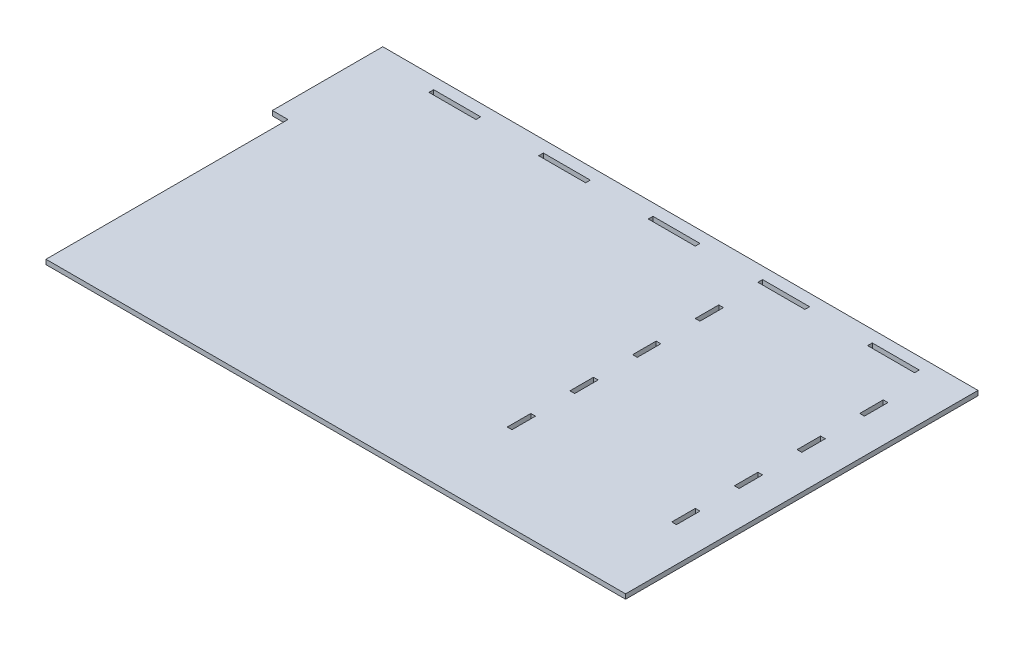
ISO-10303-21;
HEADER;
FILE_DESCRIPTION(('STEP AP214'),'2;1');
FILE_NAME('part.step','',(''),(''),'','','');
FILE_SCHEMA(('AUTOMOTIVE_DESIGN { 1 0 10303 214 1 1 1 1 }'));
ENDSEC;
DATA;
#1=APPLICATION_CONTEXT('core data for automotive mechanical design processes');
#2=APPLICATION_PROTOCOL_DEFINITION('international standard','automotive_design',2000,#1);
#3=PRODUCT_CONTEXT('',#1,'mechanical');
#4=PRODUCT('Part','Part','',(#3));
#5=PRODUCT_RELATED_PRODUCT_CATEGORY('part','',(#4));
#6=PRODUCT_DEFINITION_FORMATION('','',#4);
#7=PRODUCT_DEFINITION_CONTEXT('part definition',#1,'design');
#8=PRODUCT_DEFINITION('design','',#6,#7);
#9=PRODUCT_DEFINITION_SHAPE('','',#8);
#10=(LENGTH_UNIT() NAMED_UNIT(*) SI_UNIT(.MILLI.,.METRE.));
#11=(NAMED_UNIT(*) PLANE_ANGLE_UNIT() SI_UNIT($,.RADIAN.));
#12=(NAMED_UNIT(*) SI_UNIT($,.STERADIAN.) SOLID_ANGLE_UNIT());
#13=UNCERTAINTY_MEASURE_WITH_UNIT(LENGTH_MEASURE(1.E-05),#10,'distance_accuracy_value','');
#14=(GEOMETRIC_REPRESENTATION_CONTEXT(3) GLOBAL_UNCERTAINTY_ASSIGNED_CONTEXT((#13)) GLOBAL_UNIT_ASSIGNED_CONTEXT((#10,
#11,#12)) REPRESENTATION_CONTEXT('',''));
#15=CARTESIAN_POINT('',(0.,0.,0.));
#16=DIRECTION('',(0.,0.,1.));
#17=DIRECTION('',(1.,0.,0.));
#18=AXIS2_PLACEMENT_3D('',#15,#16,#17);
#19=CARTESIAN_POINT('',(390.,3.,0.));
#20=DIRECTION('',(0.,0.,-1.));
#21=DIRECTION('',(-1.,0.,0.));
#22=AXIS2_PLACEMENT_3D('',#19,#20,#21);
#23=PLANE('',#22);
#24=DIRECTION('',(1.,0.,0.));
#25=VECTOR('',#24,1.);
#26=CARTESIAN_POINT('',(390.,3.,0.));
#27=LINE('',#26,#25);
#28=CARTESIAN_POINT('',(10.,3.,0.));
#29=VERTEX_POINT('',#28);
#30=CARTESIAN_POINT('',(380.,3.,0.));
#31=VERTEX_POINT('',#30);
#32=EDGE_CURVE('E751',#29,#31,#27,.T.);
#33=ORIENTED_EDGE('',*,*,#32,.F.);
#34=DIRECTION('',(0.,1.,0.));
#35=VECTOR('',#34,1.);
#36=CARTESIAN_POINT('',(10.,-7.,0.));
#37=LINE('',#36,#35);
#38=CARTESIAN_POINT('',(10.,0.,0.));
#39=VERTEX_POINT('',#38);
#40=EDGE_CURVE('E575',#39,#29,#37,.T.);
#41=ORIENTED_EDGE('',*,*,#40,.F.);
#42=DIRECTION('',(1.,0.,0.));
#43=VECTOR('',#42,1.);
#44=CARTESIAN_POINT('',(390.,0.,0.));
#45=LINE('',#44,#43);
#46=CARTESIAN_POINT('',(380.,0.,0.));
#47=VERTEX_POINT('',#46);
#48=EDGE_CURVE('E618',#39,#47,#45,.T.);
#49=ORIENTED_EDGE('',*,*,#48,.T.);
#50=DIRECTION('',(0.,1.,0.));
#51=VECTOR('',#50,1.);
#52=CARTESIAN_POINT('',(380.,-7.,0.));
#53=LINE('',#52,#51);
#54=EDGE_CURVE('E586',#47,#31,#53,.T.);
#55=ORIENTED_EDGE('',*,*,#54,.T.);
#56=EDGE_LOOP('',(#33,#41,#49,#55));
#57=FACE_BOUND('',#56,.T.);
#58=ADVANCED_FACE('F34',(#57),#23,.F.);
#59=CARTESIAN_POINT('',(0.,3.,-225.));
#60=DIRECTION('',(0.,0.,1.));
#61=DIRECTION('',(1.,0.,0.));
#62=AXIS2_PLACEMENT_3D('',#59,#60,#61);
#63=PLANE('',#62);
#64=DIRECTION('',(-1.,0.,0.));
#65=VECTOR('',#64,1.);
#66=CARTESIAN_POINT('',(0.,3.,-225.));
#67=LINE('',#66,#65);
#68=CARTESIAN_POINT('',(380.,3.,-225.));
#69=VERTEX_POINT('',#68);
#70=CARTESIAN_POINT('',(0.,3.,-225.));
#71=VERTEX_POINT('',#70);
#72=EDGE_CURVE('E753',#69,#71,#67,.T.);
#73=ORIENTED_EDGE('',*,*,#72,.F.);
#74=DIRECTION('',(0.,1.,0.));
#75=VECTOR('',#74,1.);
#76=CARTESIAN_POINT('',(380.,-7.,-225.));
#77=LINE('',#76,#75);
#78=CARTESIAN_POINT('',(380.,0.,-225.));
#79=VERTEX_POINT('',#78);
#80=EDGE_CURVE('E585',#79,#69,#77,.T.);
#81=ORIENTED_EDGE('',*,*,#80,.F.);
#82=DIRECTION('',(-1.,0.,0.));
#83=VECTOR('',#82,1.);
#84=CARTESIAN_POINT('',(0.,0.,-225.));
#85=LINE('',#84,#83);
#86=CARTESIAN_POINT('',(0.,0.,-225.));
#87=VERTEX_POINT('',#86);
#88=EDGE_CURVE('E761',#79,#87,#85,.T.);
#89=ORIENTED_EDGE('',*,*,#88,.T.);
#90=DIRECTION('',(0.,-1.,0.));
#91=VECTOR('',#90,1.);
#92=CARTESIAN_POINT('',(0.,3.,-225.));
#93=LINE('',#92,#91);
#94=EDGE_CURVE('E759',#71,#87,#93,.T.);
#95=ORIENTED_EDGE('',*,*,#94,.F.);
#96=EDGE_LOOP('',(#73,#81,#89,#95));
#97=FACE_BOUND('',#96,.T.);
#98=ADVANCED_FACE('F901',(#97),#63,.F.);
#99=CARTESIAN_POINT('',(0.,3.,0.));
#100=DIRECTION('',(1.,0.,0.));
#101=DIRECTION('',(0.,0.,-1.));
#102=AXIS2_PLACEMENT_3D('',#99,#100,#101);
#103=PLANE('',#102);
#104=DIRECTION('',(0.,0.,1.));
#105=VECTOR('',#104,1.);
#106=CARTESIAN_POINT('',(0.,0.,0.));
#107=LINE('',#106,#105);
#108=CARTESIAN_POINT('',(0.,0.,-154.5));
#109=VERTEX_POINT('',#108);
#110=EDGE_CURVE('E754',#87,#109,#107,.T.);
#111=ORIENTED_EDGE('',*,*,#110,.T.);
#112=DIRECTION('',(0.,1.,0.));
#113=VECTOR('',#112,1.);
#114=CARTESIAN_POINT('',(0.,-7.,-154.5));
#115=LINE('',#114,#113);
#116=CARTESIAN_POINT('',(0.,3.,-154.5));
#117=VERTEX_POINT('',#116);
#118=EDGE_CURVE('E576',#109,#117,#115,.T.);
#119=ORIENTED_EDGE('',*,*,#118,.T.);
#120=DIRECTION('',(0.,0.,1.));
#121=VECTOR('',#120,1.);
#122=CARTESIAN_POINT('',(0.,3.,0.));
#123=LINE('',#122,#121);
#124=EDGE_CURVE('E756',#71,#117,#123,.T.);
#125=ORIENTED_EDGE('',*,*,#124,.F.);
#126=ORIENTED_EDGE('',*,*,#94,.T.);
#127=EDGE_LOOP('',(#111,#119,#125,#126));
#128=FACE_BOUND('',#127,.T.);
#129=ADVANCED_FACE('F861',(#128),#103,.F.);
#130=CARTESIAN_POINT('',(0.,3.,0.));
#131=DIRECTION('',(0.,-1.,0.));
#132=DIRECTION('',(0.,0.,-1.));
#133=AXIS2_PLACEMENT_3D('',#130,#131,#132);
#134=PLANE('',#133);
#135=DIRECTION('',(0.,0.,1.));
#136=VECTOR('',#135,1.);
#137=CARTESIAN_POINT('',(250.,3.,-149.5));
#138=LINE('',#137,#136);
#139=CARTESIAN_POINT('',(250.,3.,-149.5));
#140=VERTEX_POINT('',#139);
#141=CARTESIAN_POINT('',(250.,3.,-134.5));
#142=VERTEX_POINT('',#141);
#143=EDGE_CURVE('E476',#140,#142,#138,.T.);
#144=ORIENTED_EDGE('',*,*,#143,.F.);
#145=DIRECTION('',(-1.,0.,0.));
#146=VECTOR('',#145,1.);
#147=CARTESIAN_POINT('',(253.,3.,-149.5));
#148=LINE('',#147,#146);
#149=CARTESIAN_POINT('',(253.,3.,-149.5));
#150=VERTEX_POINT('',#149);
#151=EDGE_CURVE('E48',#150,#140,#148,.T.);
#152=ORIENTED_EDGE('',*,*,#151,.F.);
#153=DIRECTION('',(0.,0.,-1.));
#154=VECTOR('',#153,1.);
#155=CARTESIAN_POINT('',(253.,3.,-134.5));
#156=LINE('',#155,#154);
#157=CARTESIAN_POINT('',(253.,3.,-134.5));
#158=VERTEX_POINT('',#157);
#159=EDGE_CURVE('E483',#158,#150,#156,.T.);
#160=ORIENTED_EDGE('',*,*,#159,.F.);
#161=DIRECTION('',(1.,0.,0.));
#162=VECTOR('',#161,1.);
#163=CARTESIAN_POINT('',(250.,3.,-134.5));
#164=LINE('',#163,#162);
#165=EDGE_CURVE('E480',#142,#158,#164,.T.);
#166=ORIENTED_EDGE('',*,*,#165,.F.);
#167=EDGE_LOOP('',(#144,#152,#160,#166));
#168=FACE_BOUND('',#167,.T.);
#169=DIRECTION('',(0.,0.,1.));
#170=VECTOR('',#169,1.);
#171=CARTESIAN_POINT('',(250.,3.,-109.5));
#172=LINE('',#171,#170);
#173=CARTESIAN_POINT('',(250.,3.,-109.5));
#174=VERTEX_POINT('',#173);
#175=CARTESIAN_POINT('',(250.,3.,-94.5000000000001));
#176=VERTEX_POINT('',#175);
#177=EDGE_CURVE('E496',#174,#176,#172,.T.);
#178=ORIENTED_EDGE('',*,*,#177,.F.);
#179=DIRECTION('',(-1.,0.,0.));
#180=VECTOR('',#179,1.);
#181=CARTESIAN_POINT('',(253.,3.,-109.5));
#182=LINE('',#181,#180);
#183=CARTESIAN_POINT('',(253.,3.,-109.5));
#184=VERTEX_POINT('',#183);
#185=EDGE_CURVE('E56',#184,#174,#182,.T.);
#186=ORIENTED_EDGE('',*,*,#185,.F.);
#187=DIRECTION('',(0.,0.,-1.));
#188=VECTOR('',#187,1.);
#189=CARTESIAN_POINT('',(253.,3.,-94.5000000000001));
#190=LINE('',#189,#188);
#191=CARTESIAN_POINT('',(253.,3.,-94.5000000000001));
#192=VERTEX_POINT('',#191);
#193=EDGE_CURVE('E503',#192,#184,#190,.T.);
#194=ORIENTED_EDGE('',*,*,#193,.F.);
#195=DIRECTION('',(1.,0.,0.));
#196=VECTOR('',#195,1.);
#197=CARTESIAN_POINT('',(250.,3.,-94.5000000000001));
#198=LINE('',#197,#196);
#199=EDGE_CURVE('E500',#176,#192,#198,.T.);
#200=ORIENTED_EDGE('',*,*,#199,.F.);
#201=EDGE_LOOP('',(#178,#186,#194,#200));
#202=FACE_BOUND('',#201,.T.);
#203=DIRECTION('',(0.,0.,1.));
#204=VECTOR('',#203,1.);
#205=CARTESIAN_POINT('',(250.,3.,-69.5000000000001));
#206=LINE('',#205,#204);
#207=CARTESIAN_POINT('',(250.,3.,-69.5000000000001));
#208=VERTEX_POINT('',#207);
#209=CARTESIAN_POINT('',(250.,3.,-54.5000000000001));
#210=VERTEX_POINT('',#209);
#211=EDGE_CURVE('E515',#208,#210,#206,.T.);
#212=ORIENTED_EDGE('',*,*,#211,.F.);
#213=DIRECTION('',(-1.,0.,0.));
#214=VECTOR('',#213,1.);
#215=CARTESIAN_POINT('',(253.,3.,-69.5000000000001));
#216=LINE('',#215,#214);
#217=CARTESIAN_POINT('',(253.,3.,-69.5000000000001));
#218=VERTEX_POINT('',#217);
#219=EDGE_CURVE('E513',#218,#208,#216,.T.);
#220=ORIENTED_EDGE('',*,*,#219,.F.);
#221=DIRECTION('',(0.,0.,-1.));
#222=VECTOR('',#221,1.);
#223=CARTESIAN_POINT('',(253.,3.,-54.5000000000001));
#224=LINE('',#223,#222);
#225=CARTESIAN_POINT('',(253.,3.,-54.5000000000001));
#226=VERTEX_POINT('',#225);
#227=EDGE_CURVE('E522',#226,#218,#224,.T.);
#228=ORIENTED_EDGE('',*,*,#227,.F.);
#229=DIRECTION('',(1.,0.,0.));
#230=VECTOR('',#229,1.);
#231=CARTESIAN_POINT('',(250.,3.,-54.5000000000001));
#232=LINE('',#231,#230);
#233=EDGE_CURVE('E519',#210,#226,#232,.T.);
#234=ORIENTED_EDGE('',*,*,#233,.F.);
#235=EDGE_LOOP('',(#212,#220,#228,#234));
#236=FACE_BOUND('',#235,.T.);
#237=DIRECTION('',(-1.,0.,0.));
#238=VECTOR('',#237,1.);
#239=CARTESIAN_POINT('',(355.,3.,-69.5000000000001));
#240=LINE('',#239,#238);
#241=CARTESIAN_POINT('',(358.,3.,-69.5000000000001));
#242=VERTEX_POINT('',#241);
#243=CARTESIAN_POINT('',(355.,3.,-69.5000000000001));
#244=VERTEX_POINT('',#243);
#245=EDGE_CURVE('E534',#242,#244,#240,.T.);
#246=ORIENTED_EDGE('',*,*,#245,.F.);
#247=DIRECTION('',(0.,0.,-1.));
#248=VECTOR('',#247,1.);
#249=CARTESIAN_POINT('',(358.,3.,-69.5000000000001));
#250=LINE('',#249,#248);
#251=CARTESIAN_POINT('',(358.,3.,-54.5000000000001));
#252=VERTEX_POINT('',#251);
#253=EDGE_CURVE('E432',#252,#242,#250,.T.);
#254=ORIENTED_EDGE('',*,*,#253,.F.);
#255=DIRECTION('',(1.,0.,0.));
#256=VECTOR('',#255,1.);
#257=CARTESIAN_POINT('',(358.,3.,-54.5000000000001));
#258=LINE('',#257,#256);
#259=CARTESIAN_POINT('',(355.,3.,-54.5000000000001));
#260=VERTEX_POINT('',#259);
#261=EDGE_CURVE('E540',#260,#252,#258,.T.);
#262=ORIENTED_EDGE('',*,*,#261,.F.);
#263=DIRECTION('',(0.,0.,1.));
#264=VECTOR('',#263,1.);
#265=CARTESIAN_POINT('',(355.,3.,-54.5000000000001));
#266=LINE('',#265,#264);
#267=EDGE_CURVE('E537',#244,#260,#266,.T.);
#268=ORIENTED_EDGE('',*,*,#267,.F.);
#269=EDGE_LOOP('',(#246,#254,#262,#268));
#270=FACE_BOUND('',#269,.T.);
#271=DIRECTION('',(-1.,0.,0.));
#272=VECTOR('',#271,1.);
#273=CARTESIAN_POINT('',(355.,3.,-109.5));
#274=LINE('',#273,#272);
#275=CARTESIAN_POINT('',(358.,3.,-109.5));
#276=VERTEX_POINT('',#275);
#277=CARTESIAN_POINT('',(355.,3.,-109.5));
#278=VERTEX_POINT('',#277);
#279=EDGE_CURVE('E415',#276,#278,#274,.T.);
#280=ORIENTED_EDGE('',*,*,#279,.F.);
#281=DIRECTION('',(0.,0.,-1.));
#282=VECTOR('',#281,1.);
#283=CARTESIAN_POINT('',(358.,3.,-109.5));
#284=LINE('',#283,#282);
#285=CARTESIAN_POINT('',(358.,3.,-94.5000000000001));
#286=VERTEX_POINT('',#285);
#287=EDGE_CURVE('E420',#286,#276,#284,.T.);
#288=ORIENTED_EDGE('',*,*,#287,.F.);
#289=DIRECTION('',(1.,0.,0.));
#290=VECTOR('',#289,1.);
#291=CARTESIAN_POINT('',(358.,3.,-94.5000000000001));
#292=LINE('',#291,#290);
#293=CARTESIAN_POINT('',(355.,3.,-94.5000000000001));
#294=VERTEX_POINT('',#293);
#295=EDGE_CURVE('E425',#294,#286,#292,.T.);
#296=ORIENTED_EDGE('',*,*,#295,.F.);
#297=DIRECTION('',(0.,0.,1.));
#298=VECTOR('',#297,1.);
#299=CARTESIAN_POINT('',(355.,3.,-94.5000000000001));
#300=LINE('',#299,#298);
#301=EDGE_CURVE('E404',#278,#294,#300,.T.);
#302=ORIENTED_EDGE('',*,*,#301,.F.);
#303=EDGE_LOOP('',(#280,#288,#296,#302));
#304=FACE_BOUND('',#303,.T.);
#305=DIRECTION('',(-1.,0.,0.));
#306=VECTOR('',#305,1.);
#307=CARTESIAN_POINT('',(355.,3.,-149.5));
#308=LINE('',#307,#306);
#309=CARTESIAN_POINT('',(358.,3.,-149.5));
#310=VERTEX_POINT('',#309);
#311=CARTESIAN_POINT('',(355.,3.,-149.5));
#312=VERTEX_POINT('',#311);
#313=EDGE_CURVE('E437',#310,#312,#308,.T.);
#314=ORIENTED_EDGE('',*,*,#313,.F.);
#315=DIRECTION('',(0.,0.,-1.));
#316=VECTOR('',#315,1.);
#317=CARTESIAN_POINT('',(358.,3.,-149.5));
#318=LINE('',#317,#316);
#319=CARTESIAN_POINT('',(358.,3.,-134.5));
#320=VERTEX_POINT('',#319);
#321=EDGE_CURVE('E435',#320,#310,#318,.T.);
#322=ORIENTED_EDGE('',*,*,#321,.F.);
#323=DIRECTION('',(1.,0.,0.));
#324=VECTOR('',#323,1.);
#325=CARTESIAN_POINT('',(358.,3.,-134.5));
#326=LINE('',#325,#324);
#327=CARTESIAN_POINT('',(355.,3.,-134.5));
#328=VERTEX_POINT('',#327);
#329=EDGE_CURVE('E444',#328,#320,#326,.T.);
#330=ORIENTED_EDGE('',*,*,#329,.F.);
#331=DIRECTION('',(0.,0.,1.));
#332=VECTOR('',#331,1.);
#333=CARTESIAN_POINT('',(355.,3.,-134.5));
#334=LINE('',#333,#332);
#335=EDGE_CURVE('E441',#312,#328,#334,.T.);
#336=ORIENTED_EDGE('',*,*,#335,.F.);
#337=EDGE_LOOP('',(#314,#322,#330,#336));
#338=FACE_BOUND('',#337,.T.);
#339=DIRECTION('',(0.,0.,-1.));
#340=VECTOR('',#339,1.);
#341=CARTESIAN_POINT('',(358.,3.,-174.5));
#342=LINE('',#341,#340);
#343=CARTESIAN_POINT('',(358.,3.,-174.5));
#344=VERTEX_POINT('',#343);
#345=CARTESIAN_POINT('',(358.,3.,-189.5));
#346=VERTEX_POINT('',#345);
#347=EDGE_CURVE('E458',#344,#346,#342,.T.);
#348=ORIENTED_EDGE('',*,*,#347,.F.);
#349=DIRECTION('',(1.,0.,0.));
#350=VECTOR('',#349,1.);
#351=CARTESIAN_POINT('',(355.,3.,-174.5));
#352=LINE('',#351,#350);
#353=CARTESIAN_POINT('',(355.,3.,-174.5));
#354=VERTEX_POINT('',#353);
#355=EDGE_CURVE('E456',#354,#344,#352,.T.);
#356=ORIENTED_EDGE('',*,*,#355,.F.);
#357=DIRECTION('',(0.,0.,1.));
#358=VECTOR('',#357,1.);
#359=CARTESIAN_POINT('',(355.,3.,-189.5));
#360=LINE('',#359,#358);
#361=CARTESIAN_POINT('',(355.,3.,-189.5));
#362=VERTEX_POINT('',#361);
#363=EDGE_CURVE('E464',#362,#354,#360,.T.);
#364=ORIENTED_EDGE('',*,*,#363,.F.);
#365=DIRECTION('',(-1.,0.,0.));
#366=VECTOR('',#365,1.);
#367=CARTESIAN_POINT('',(358.,3.,-189.5));
#368=LINE('',#367,#366);
#369=EDGE_CURVE('E461',#346,#362,#368,.T.);
#370=ORIENTED_EDGE('',*,*,#369,.F.);
#371=EDGE_LOOP('',(#348,#356,#364,#370));
#372=FACE_BOUND('',#371,.T.);
#373=DIRECTION('',(1.,0.,0.));
#374=VECTOR('',#373,1.);
#375=CARTESIAN_POINT('',(253.,3.,-174.5));
#376=LINE('',#375,#374);
#377=CARTESIAN_POINT('',(250.,3.,-174.5));
#378=VERTEX_POINT('',#377);
#379=CARTESIAN_POINT('',(253.,3.,-174.5));
#380=VERTEX_POINT('',#379);
#381=EDGE_CURVE('E552',#378,#380,#376,.T.);
#382=ORIENTED_EDGE('',*,*,#381,.F.);
#383=DIRECTION('',(0.,0.,1.));
#384=VECTOR('',#383,1.);
#385=CARTESIAN_POINT('',(250.,3.,-174.5));
#386=LINE('',#385,#384);
#387=CARTESIAN_POINT('',(250.,3.,-189.5));
#388=VERTEX_POINT('',#387);
#389=EDGE_CURVE('E489',#388,#378,#386,.T.);
#390=ORIENTED_EDGE('',*,*,#389,.F.);
#391=DIRECTION('',(-1.,0.,0.));
#392=VECTOR('',#391,1.);
#393=CARTESIAN_POINT('',(250.,3.,-189.5));
#394=LINE('',#393,#392);
#395=CARTESIAN_POINT('',(253.,3.,-189.5));
#396=VERTEX_POINT('',#395);
#397=EDGE_CURVE('E558',#396,#388,#394,.T.);
#398=ORIENTED_EDGE('',*,*,#397,.F.);
#399=DIRECTION('',(0.,0.,-1.));
#400=VECTOR('',#399,1.);
#401=CARTESIAN_POINT('',(253.,3.,-189.5));
#402=LINE('',#401,#400);
#403=EDGE_CURVE('E555',#380,#396,#402,.T.);
#404=ORIENTED_EDGE('',*,*,#403,.F.);
#405=EDGE_LOOP('',(#382,#390,#398,#404));
#406=FACE_BOUND('',#405,.T.);
#407=DIRECTION('',(1.,0.,0.));
#408=VECTOR('',#407,1.);
#409=CARTESIAN_POINT('',(70.,3.,-214.5));
#410=LINE('',#409,#408);
#411=CARTESIAN_POINT('',(40.,3.,-214.5));
#412=VERTEX_POINT('',#411);
#413=CARTESIAN_POINT('',(70.,3.,-214.5));
#414=VERTEX_POINT('',#413);
#415=EDGE_CURVE('E607',#412,#414,#410,.T.);
#416=ORIENTED_EDGE('',*,*,#415,.F.);
#417=DIRECTION('',(0.,0.,1.));
#418=VECTOR('',#417,1.);
#419=CARTESIAN_POINT('',(40.,3.,-214.5));
#420=LINE('',#419,#418);
#421=CARTESIAN_POINT('',(40.,3.,-217.5));
#422=VERTEX_POINT('',#421);
#423=EDGE_CURVE('E605',#422,#412,#420,.T.);
#424=ORIENTED_EDGE('',*,*,#423,.F.);
#425=DIRECTION('',(-1.,0.,0.));
#426=VECTOR('',#425,1.);
#427=CARTESIAN_POINT('',(40.,3.,-217.5));
#428=LINE('',#427,#426);
#429=CARTESIAN_POINT('',(70.,3.,-217.5));
#430=VERTEX_POINT('',#429);
#431=EDGE_CURVE('E595',#430,#422,#428,.T.);
#432=ORIENTED_EDGE('',*,*,#431,.F.);
#433=DIRECTION('',(0.,0.,-1.));
#434=VECTOR('',#433,1.);
#435=CARTESIAN_POINT('',(70.,3.,-217.5));
#436=LINE('',#435,#434);
#437=EDGE_CURVE('E611',#414,#430,#436,.T.);
#438=ORIENTED_EDGE('',*,*,#437,.F.);
#439=EDGE_LOOP('',(#416,#424,#432,#438));
#440=FACE_BOUND('',#439,.T.);
#441=DIRECTION('',(-1.,0.,0.));
#442=VECTOR('',#441,1.);
#443=CARTESIAN_POINT('',(180.,3.,-217.5));
#444=LINE('',#443,#442);
#445=CARTESIAN_POINT('',(210.,3.,-217.5));
#446=VERTEX_POINT('',#445);
#447=CARTESIAN_POINT('',(180.,3.,-217.5));
#448=VERTEX_POINT('',#447);
#449=EDGE_CURVE('E641',#446,#448,#444,.T.);
#450=ORIENTED_EDGE('',*,*,#449,.F.);
#451=DIRECTION('',(0.,0.,-1.));
#452=VECTOR('',#451,1.);
#453=CARTESIAN_POINT('',(210.,3.,-217.5));
#454=LINE('',#453,#452);
#455=CARTESIAN_POINT('',(210.,3.,-214.5));
#456=VERTEX_POINT('',#455);
#457=EDGE_CURVE('E639',#456,#446,#454,.T.);
#458=ORIENTED_EDGE('',*,*,#457,.F.);
#459=DIRECTION('',(1.,0.,0.));
#460=VECTOR('',#459,1.);
#461=CARTESIAN_POINT('',(210.,3.,-214.5));
#462=LINE('',#461,#460);
#463=CARTESIAN_POINT('',(180.,3.,-214.5));
#464=VERTEX_POINT('',#463);
#465=EDGE_CURVE('E629',#464,#456,#462,.T.);
#466=ORIENTED_EDGE('',*,*,#465,.F.);
#467=DIRECTION('',(0.,0.,1.));
#468=VECTOR('',#467,1.);
#469=CARTESIAN_POINT('',(180.,3.,-214.5));
#470=LINE('',#469,#468);
#471=EDGE_CURVE('E645',#448,#464,#470,.T.);
#472=ORIENTED_EDGE('',*,*,#471,.F.);
#473=EDGE_LOOP('',(#450,#458,#466,#472));
#474=FACE_BOUND('',#473,.T.);
#475=DIRECTION('',(1.,0.,0.));
#476=VECTOR('',#475,1.);
#477=CARTESIAN_POINT('',(110.,3.,-214.5));
#478=LINE('',#477,#476);
#479=CARTESIAN_POINT('',(110.,3.,-214.5));
#480=VERTEX_POINT('',#479);
#481=CARTESIAN_POINT('',(140.,3.,-214.5));
#482=VERTEX_POINT('',#481);
#483=EDGE_CURVE('E673',#480,#482,#478,.T.);
#484=ORIENTED_EDGE('',*,*,#483,.F.);
#485=DIRECTION('',(0.,0.,1.));
#486=VECTOR('',#485,1.);
#487=CARTESIAN_POINT('',(110.,3.,-217.5));
#488=LINE('',#487,#486);
#489=CARTESIAN_POINT('',(110.,3.,-217.5));
#490=VERTEX_POINT('',#489);
#491=EDGE_CURVE('E671',#490,#480,#488,.T.);
#492=ORIENTED_EDGE('',*,*,#491,.F.);
#493=DIRECTION('',(-1.,0.,0.));
#494=VECTOR('',#493,1.);
#495=CARTESIAN_POINT('',(140.,3.,-217.5));
#496=LINE('',#495,#494);
#497=CARTESIAN_POINT('',(140.,3.,-217.5));
#498=VERTEX_POINT('',#497);
#499=EDGE_CURVE('E661',#498,#490,#496,.T.);
#500=ORIENTED_EDGE('',*,*,#499,.F.);
#501=DIRECTION('',(0.,0.,-1.));
#502=VECTOR('',#501,1.);
#503=CARTESIAN_POINT('',(140.,3.,-214.5));
#504=LINE('',#503,#502);
#505=EDGE_CURVE('E677',#482,#498,#504,.T.);
#506=ORIENTED_EDGE('',*,*,#505,.F.);
#507=EDGE_LOOP('',(#484,#492,#500,#506));
#508=FACE_BOUND('',#507,.T.);
#509=DIRECTION('',(-1.,0.,0.));
#510=VECTOR('',#509,1.);
#511=CARTESIAN_POINT('',(320.,3.,-217.5));
#512=LINE('',#511,#510);
#513=CARTESIAN_POINT('',(350.,3.,-217.5));
#514=VERTEX_POINT('',#513);
#515=CARTESIAN_POINT('',(320.,3.,-217.5));
#516=VERTEX_POINT('',#515);
#517=EDGE_CURVE('E705',#514,#516,#512,.T.);
#518=ORIENTED_EDGE('',*,*,#517,.F.);
#519=DIRECTION('',(0.,0.,-1.));
#520=VECTOR('',#519,1.);
#521=CARTESIAN_POINT('',(350.,3.,-217.5));
#522=LINE('',#521,#520);
#523=CARTESIAN_POINT('',(350.,3.,-214.5));
#524=VERTEX_POINT('',#523);
#525=EDGE_CURVE('E703',#524,#514,#522,.T.);
#526=ORIENTED_EDGE('',*,*,#525,.F.);
#527=DIRECTION('',(1.,0.,0.));
#528=VECTOR('',#527,1.);
#529=CARTESIAN_POINT('',(350.,3.,-214.5));
#530=LINE('',#529,#528);
#531=CARTESIAN_POINT('',(320.,3.,-214.5));
#532=VERTEX_POINT('',#531);
#533=EDGE_CURVE('E693',#532,#524,#530,.T.);
#534=ORIENTED_EDGE('',*,*,#533,.F.);
#535=DIRECTION('',(0.,0.,1.));
#536=VECTOR('',#535,1.);
#537=CARTESIAN_POINT('',(320.,3.,-214.5));
#538=LINE('',#537,#536);
#539=EDGE_CURVE('E709',#516,#532,#538,.T.);
#540=ORIENTED_EDGE('',*,*,#539,.F.);
#541=EDGE_LOOP('',(#518,#526,#534,#540));
#542=FACE_BOUND('',#541,.T.);
#543=DIRECTION('',(1.,0.,0.));
#544=VECTOR('',#543,1.);
#545=CARTESIAN_POINT('',(250.,3.,-214.5));
#546=LINE('',#545,#544);
#547=CARTESIAN_POINT('',(250.,3.,-214.5));
#548=VERTEX_POINT('',#547);
#549=CARTESIAN_POINT('',(280.,3.,-214.5));
#550=VERTEX_POINT('',#549);
#551=EDGE_CURVE('E736',#548,#550,#546,.T.);
#552=ORIENTED_EDGE('',*,*,#551,.F.);
#553=DIRECTION('',(0.,0.,1.));
#554=VECTOR('',#553,1.);
#555=CARTESIAN_POINT('',(250.,3.,-217.5));
#556=LINE('',#555,#554);
#557=CARTESIAN_POINT('',(250.,3.,-217.5));
#558=VERTEX_POINT('',#557);
#559=EDGE_CURVE('E589',#558,#548,#556,.T.);
#560=ORIENTED_EDGE('',*,*,#559,.F.);
#561=DIRECTION('',(-1.,0.,0.));
#562=VECTOR('',#561,1.);
#563=CARTESIAN_POINT('',(280.,3.,-217.5));
#564=LINE('',#563,#562);
#565=CARTESIAN_POINT('',(280.,3.,-217.5));
#566=VERTEX_POINT('',#565);
#567=EDGE_CURVE('E725',#566,#558,#564,.T.);
#568=ORIENTED_EDGE('',*,*,#567,.F.);
#569=DIRECTION('',(0.,0.,-1.));
#570=VECTOR('',#569,1.);
#571=CARTESIAN_POINT('',(280.,3.,-214.5));
#572=LINE('',#571,#570);
#573=EDGE_CURVE('E739',#550,#566,#572,.T.);
#574=ORIENTED_EDGE('',*,*,#573,.F.);
#575=EDGE_LOOP('',(#552,#560,#568,#574));
#576=FACE_BOUND('',#575,.T.);
#577=ORIENTED_EDGE('',*,*,#124,.T.);
#578=DIRECTION('',(-1.,0.,0.));
#579=VECTOR('',#578,1.);
#580=CARTESIAN_POINT('',(0.,3.,-154.5));
#581=LINE('',#580,#579);
#582=CARTESIAN_POINT('',(10.,3.,-154.5));
#583=VERTEX_POINT('',#582);
#584=EDGE_CURVE('E573',#583,#117,#581,.T.);
#585=ORIENTED_EDGE('',*,*,#584,.F.);
#586=DIRECTION('',(0.,0.,-1.));
#587=VECTOR('',#586,1.);
#588=CARTESIAN_POINT('',(10.,3.,-154.5));
#589=LINE('',#588,#587);
#590=EDGE_CURVE('E564',#29,#583,#589,.T.);
#591=ORIENTED_EDGE('',*,*,#590,.F.);
#592=ORIENTED_EDGE('',*,*,#32,.T.);
#593=DIRECTION('',(0.,0.,1.));
#594=VECTOR('',#593,1.);
#595=CARTESIAN_POINT('',(380.,3.,0.));
#596=LINE('',#595,#594);
#597=EDGE_CURVE('E579',#69,#31,#596,.T.);
#598=ORIENTED_EDGE('',*,*,#597,.F.);
#599=ORIENTED_EDGE('',*,*,#72,.T.);
#600=EDGE_LOOP('',(#577,#585,#591,#592,#598,#599));
#601=FACE_BOUND('',#600,.T.);
#602=ADVANCED_FACE('F422',(#168,#202,#236,#270,#304,#338,#372,#406,#440,#474,#508,#542,#576,
#601),#134,.F.);
#603=CARTESIAN_POINT('',(0.,0.,0.));
#604=DIRECTION('',(0.,-1.,0.));
#605=DIRECTION('',(0.,0.,-1.));
#606=AXIS2_PLACEMENT_3D('',#603,#604,#605);
#607=PLANE('',#606);
#608=DIRECTION('',(1.,0.,0.));
#609=VECTOR('',#608,1.);
#610=CARTESIAN_POINT('',(0.,0.,-149.5));
#611=LINE('',#610,#609);
#612=CARTESIAN_POINT('',(250.,0.,-149.5));
#613=VERTEX_POINT('',#612);
#614=CARTESIAN_POINT('',(253.,0.,-149.5));
#615=VERTEX_POINT('',#614);
#616=EDGE_CURVE('E11',#613,#615,#611,.T.);
#617=ORIENTED_EDGE('',*,*,#616,.F.);
#618=DIRECTION('',(0.,0.,-1.));
#619=VECTOR('',#618,1.);
#620=CARTESIAN_POINT('',(250.,0.,0.));
#621=LINE('',#620,#619);
#622=CARTESIAN_POINT('',(250.,0.,-134.5));
#623=VERTEX_POINT('',#622);
#624=EDGE_CURVE('E835',#623,#613,#621,.T.);
#625=ORIENTED_EDGE('',*,*,#624,.F.);
#626=DIRECTION('',(-1.,0.,0.));
#627=VECTOR('',#626,1.);
#628=CARTESIAN_POINT('',(0.,0.,-134.5));
#629=LINE('',#628,#627);
#630=CARTESIAN_POINT('',(253.,0.,-134.5));
#631=VERTEX_POINT('',#630);
#632=EDGE_CURVE('E837',#631,#623,#629,.T.);
#633=ORIENTED_EDGE('',*,*,#632,.F.);
#634=DIRECTION('',(0.,0.,1.));
#635=VECTOR('',#634,1.);
#636=CARTESIAN_POINT('',(253.,0.,0.));
#637=LINE('',#636,#635);
#638=EDGE_CURVE('E41',#615,#631,#637,.T.);
#639=ORIENTED_EDGE('',*,*,#638,.F.);
#640=EDGE_LOOP('',(#617,#625,#633,#639));
#641=FACE_BOUND('',#640,.T.);
#642=DIRECTION('',(1.,0.,0.));
#643=VECTOR('',#642,1.);
#644=CARTESIAN_POINT('',(0.,0.,-109.5));
#645=LINE('',#644,#643);
#646=CARTESIAN_POINT('',(250.,0.,-109.5));
#647=VERTEX_POINT('',#646);
#648=CARTESIAN_POINT('',(253.,0.,-109.5));
#649=VERTEX_POINT('',#648);
#650=EDGE_CURVE('E833',#647,#649,#645,.T.);
#651=ORIENTED_EDGE('',*,*,#650,.F.);
#652=DIRECTION('',(0.,0.,-1.));
#653=VECTOR('',#652,1.);
#654=CARTESIAN_POINT('',(250.,0.,0.));
#655=LINE('',#654,#653);
#656=CARTESIAN_POINT('',(250.,0.,-94.5000000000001));
#657=VERTEX_POINT('',#656);
#658=EDGE_CURVE('E826',#657,#647,#655,.T.);
#659=ORIENTED_EDGE('',*,*,#658,.F.);
#660=DIRECTION('',(-1.,0.,0.));
#661=VECTOR('',#660,1.);
#662=CARTESIAN_POINT('',(0.,0.,-94.5000000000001));
#663=LINE('',#662,#661);
#664=CARTESIAN_POINT('',(253.,0.,-94.5000000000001));
#665=VERTEX_POINT('',#664);
#666=EDGE_CURVE('E828',#665,#657,#663,.T.);
#667=ORIENTED_EDGE('',*,*,#666,.F.);
#668=DIRECTION('',(0.,0.,1.));
#669=VECTOR('',#668,1.);
#670=CARTESIAN_POINT('',(253.,0.,0.));
#671=LINE('',#670,#669);
#672=EDGE_CURVE('E831',#649,#665,#671,.T.);
#673=ORIENTED_EDGE('',*,*,#672,.F.);
#674=EDGE_LOOP('',(#651,#659,#667,#673));
#675=FACE_BOUND('',#674,.T.);
#676=DIRECTION('',(1.,0.,0.));
#677=VECTOR('',#676,1.);
#678=CARTESIAN_POINT('',(0.,0.,-69.5000000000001));
#679=LINE('',#678,#677);
#680=CARTESIAN_POINT('',(250.,0.,-69.5000000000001));
#681=VERTEX_POINT('',#680);
#682=CARTESIAN_POINT('',(253.,0.,-69.5000000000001));
#683=VERTEX_POINT('',#682);
#684=EDGE_CURVE('E824',#681,#683,#679,.T.);
#685=ORIENTED_EDGE('',*,*,#684,.F.);
#686=DIRECTION('',(0.,0.,-1.));
#687=VECTOR('',#686,1.);
#688=CARTESIAN_POINT('',(250.,0.,0.));
#689=LINE('',#688,#687);
#690=CARTESIAN_POINT('',(250.,0.,-54.5000000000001));
#691=VERTEX_POINT('',#690);
#692=EDGE_CURVE('E817',#691,#681,#689,.T.);
#693=ORIENTED_EDGE('',*,*,#692,.F.);
#694=DIRECTION('',(-1.,0.,0.));
#695=VECTOR('',#694,1.);
#696=CARTESIAN_POINT('',(0.,0.,-54.5000000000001));
#697=LINE('',#696,#695);
#698=CARTESIAN_POINT('',(253.,0.,-54.5000000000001));
#699=VERTEX_POINT('',#698);
#700=EDGE_CURVE('E819',#699,#691,#697,.T.);
#701=ORIENTED_EDGE('',*,*,#700,.F.);
#702=DIRECTION('',(0.,0.,1.));
#703=VECTOR('',#702,1.);
#704=CARTESIAN_POINT('',(253.,0.,0.));
#705=LINE('',#704,#703);
#706=EDGE_CURVE('E822',#683,#699,#705,.T.);
#707=ORIENTED_EDGE('',*,*,#706,.F.);
#708=EDGE_LOOP('',(#685,#693,#701,#707));
#709=FACE_BOUND('',#708,.T.);
#710=DIRECTION('',(0.,0.,1.));
#711=VECTOR('',#710,1.);
#712=CARTESIAN_POINT('',(358.,0.,0.));
#713=LINE('',#712,#711);
#714=CARTESIAN_POINT('',(358.,0.,-69.5000000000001));
#715=VERTEX_POINT('',#714);
#716=CARTESIAN_POINT('',(358.,0.,-54.5000000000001));
#717=VERTEX_POINT('',#716);
#718=EDGE_CURVE('E815',#715,#717,#713,.T.);
#719=ORIENTED_EDGE('',*,*,#718,.F.);
#720=DIRECTION('',(1.,0.,0.));
#721=VECTOR('',#720,1.);
#722=CARTESIAN_POINT('',(0.,0.,-69.5000000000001));
#723=LINE('',#722,#721);
#724=CARTESIAN_POINT('',(355.,0.,-69.5000000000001));
#725=VERTEX_POINT('',#724);
#726=EDGE_CURVE('E808',#725,#715,#723,.T.);
#727=ORIENTED_EDGE('',*,*,#726,.F.);
#728=DIRECTION('',(0.,0.,-1.));
#729=VECTOR('',#728,1.);
#730=CARTESIAN_POINT('',(355.,0.,0.));
#731=LINE('',#730,#729);
#732=CARTESIAN_POINT('',(355.,0.,-54.5000000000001));
#733=VERTEX_POINT('',#732);
#734=EDGE_CURVE('E810',#733,#725,#731,.T.);
#735=ORIENTED_EDGE('',*,*,#734,.F.);
#736=DIRECTION('',(-1.,0.,0.));
#737=VECTOR('',#736,1.);
#738=CARTESIAN_POINT('',(0.,0.,-54.5000000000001));
#739=LINE('',#738,#737);
#740=EDGE_CURVE('E813',#717,#733,#739,.T.);
#741=ORIENTED_EDGE('',*,*,#740,.F.);
#742=EDGE_LOOP('',(#719,#727,#735,#741));
#743=FACE_BOUND('',#742,.T.);
#744=DIRECTION('',(0.,0.,1.));
#745=VECTOR('',#744,1.);
#746=CARTESIAN_POINT('',(358.,0.,0.));
#747=LINE('',#746,#745);
#748=CARTESIAN_POINT('',(358.,0.,-109.5));
#749=VERTEX_POINT('',#748);
#750=CARTESIAN_POINT('',(358.,0.,-94.5000000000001));
#751=VERTEX_POINT('',#750);
#752=EDGE_CURVE('E806',#749,#751,#747,.T.);
#753=ORIENTED_EDGE('',*,*,#752,.F.);
#754=DIRECTION('',(1.,0.,0.));
#755=VECTOR('',#754,1.);
#756=CARTESIAN_POINT('',(0.,0.,-109.5));
#757=LINE('',#756,#755);
#758=CARTESIAN_POINT('',(355.,0.,-109.5));
#759=VERTEX_POINT('',#758);
#760=EDGE_CURVE('E801',#759,#749,#757,.T.);
#761=ORIENTED_EDGE('',*,*,#760,.F.);
#762=DIRECTION('',(0.,0.,-1.));
#763=VECTOR('',#762,1.);
#764=CARTESIAN_POINT('',(355.,0.,0.));
#765=LINE('',#764,#763);
#766=CARTESIAN_POINT('',(355.,0.,-94.5000000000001));
#767=VERTEX_POINT('',#766);
#768=EDGE_CURVE('E407',#767,#759,#765,.T.);
#769=ORIENTED_EDGE('',*,*,#768,.F.);
#770=DIRECTION('',(-1.,0.,0.));
#771=VECTOR('',#770,1.);
#772=CARTESIAN_POINT('',(0.,0.,-94.5000000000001));
#773=LINE('',#772,#771);
#774=EDGE_CURVE('E804',#751,#767,#773,.T.);
#775=ORIENTED_EDGE('',*,*,#774,.F.);
#776=EDGE_LOOP('',(#753,#761,#769,#775));
#777=FACE_BOUND('',#776,.T.);
#778=DIRECTION('',(0.,0.,1.));
#779=VECTOR('',#778,1.);
#780=CARTESIAN_POINT('',(358.,0.,0.));
#781=LINE('',#780,#779);
#782=CARTESIAN_POINT('',(358.,0.,-149.5));
#783=VERTEX_POINT('',#782);
#784=CARTESIAN_POINT('',(358.,0.,-134.5));
#785=VERTEX_POINT('',#784);
#786=EDGE_CURVE('E799',#783,#785,#781,.T.);
#787=ORIENTED_EDGE('',*,*,#786,.F.);
#788=DIRECTION('',(1.,0.,0.));
#789=VECTOR('',#788,1.);
#790=CARTESIAN_POINT('',(0.,0.,-149.5));
#791=LINE('',#790,#789);
#792=CARTESIAN_POINT('',(355.,0.,-149.5));
#793=VERTEX_POINT('',#792);
#794=EDGE_CURVE('E792',#793,#783,#791,.T.);
#795=ORIENTED_EDGE('',*,*,#794,.F.);
#796=DIRECTION('',(0.,0.,-1.));
#797=VECTOR('',#796,1.);
#798=CARTESIAN_POINT('',(355.,0.,0.));
#799=LINE('',#798,#797);
#800=CARTESIAN_POINT('',(355.,0.,-134.5));
#801=VERTEX_POINT('',#800);
#802=EDGE_CURVE('E794',#801,#793,#799,.T.);
#803=ORIENTED_EDGE('',*,*,#802,.F.);
#804=DIRECTION('',(-1.,0.,0.));
#805=VECTOR('',#804,1.);
#806=CARTESIAN_POINT('',(0.,0.,-134.5));
#807=LINE('',#806,#805);
#808=EDGE_CURVE('E797',#785,#801,#807,.T.);
#809=ORIENTED_EDGE('',*,*,#808,.F.);
#810=EDGE_LOOP('',(#787,#795,#803,#809));
#811=FACE_BOUND('',#810,.T.);
#812=DIRECTION('',(-1.,0.,0.));
#813=VECTOR('',#812,1.);
#814=CARTESIAN_POINT('',(0.,0.,-174.5));
#815=LINE('',#814,#813);
#816=CARTESIAN_POINT('',(358.,0.,-174.5));
#817=VERTEX_POINT('',#816);
#818=CARTESIAN_POINT('',(355.,0.,-174.5));
#819=VERTEX_POINT('',#818);
#820=EDGE_CURVE('E790',#817,#819,#815,.T.);
#821=ORIENTED_EDGE('',*,*,#820,.F.);
#822=DIRECTION('',(0.,0.,1.));
#823=VECTOR('',#822,1.);
#824=CARTESIAN_POINT('',(358.,0.,0.));
#825=LINE('',#824,#823);
#826=CARTESIAN_POINT('',(358.,0.,-189.5));
#827=VERTEX_POINT('',#826);
#828=EDGE_CURVE('E783',#827,#817,#825,.T.);
#829=ORIENTED_EDGE('',*,*,#828,.F.);
#830=DIRECTION('',(1.,0.,0.));
#831=VECTOR('',#830,1.);
#832=CARTESIAN_POINT('',(0.,0.,-189.5));
#833=LINE('',#832,#831);
#834=CARTESIAN_POINT('',(355.,0.,-189.5));
#835=VERTEX_POINT('',#834);
#836=EDGE_CURVE('E785',#835,#827,#833,.T.);
#837=ORIENTED_EDGE('',*,*,#836,.F.);
#838=DIRECTION('',(0.,0.,-1.));
#839=VECTOR('',#838,1.);
#840=CARTESIAN_POINT('',(355.,0.,0.));
#841=LINE('',#840,#839);
#842=EDGE_CURVE('E788',#819,#835,#841,.T.);
#843=ORIENTED_EDGE('',*,*,#842,.F.);
#844=EDGE_LOOP('',(#821,#829,#837,#843));
#845=FACE_BOUND('',#844,.T.);
#846=DIRECTION('',(0.,0.,-1.));
#847=VECTOR('',#846,1.);
#848=CARTESIAN_POINT('',(250.,0.,0.));
#849=LINE('',#848,#847);
#850=CARTESIAN_POINT('',(250.,0.,-174.5));
#851=VERTEX_POINT('',#850);
#852=CARTESIAN_POINT('',(250.,0.,-189.5));
#853=VERTEX_POINT('',#852);
#854=EDGE_CURVE('E781',#851,#853,#849,.T.);
#855=ORIENTED_EDGE('',*,*,#854,.F.);
#856=DIRECTION('',(-1.,0.,0.));
#857=VECTOR('',#856,1.);
#858=CARTESIAN_POINT('',(0.,0.,-174.5));
#859=LINE('',#858,#857);
#860=CARTESIAN_POINT('',(253.,0.,-174.5));
#861=VERTEX_POINT('',#860);
#862=EDGE_CURVE('E774',#861,#851,#859,.T.);
#863=ORIENTED_EDGE('',*,*,#862,.F.);
#864=DIRECTION('',(0.,0.,1.));
#865=VECTOR('',#864,1.);
#866=CARTESIAN_POINT('',(253.,0.,0.));
#867=LINE('',#866,#865);
#868=CARTESIAN_POINT('',(253.,0.,-189.5));
#869=VERTEX_POINT('',#868);
#870=EDGE_CURVE('E776',#869,#861,#867,.T.);
#871=ORIENTED_EDGE('',*,*,#870,.F.);
#872=DIRECTION('',(1.,0.,0.));
#873=VECTOR('',#872,1.);
#874=CARTESIAN_POINT('',(0.,0.,-189.5));
#875=LINE('',#874,#873);
#876=EDGE_CURVE('E779',#853,#869,#875,.T.);
#877=ORIENTED_EDGE('',*,*,#876,.F.);
#878=EDGE_LOOP('',(#855,#863,#871,#877));
#879=FACE_BOUND('',#878,.T.);
#880=DIRECTION('',(1.,0.,0.));
#881=VECTOR('',#880,1.);
#882=CARTESIAN_POINT('',(0.,0.,-154.5));
#883=LINE('',#882,#881);
#884=CARTESIAN_POINT('',(10.,0.,-154.5));
#885=VERTEX_POINT('',#884);
#886=EDGE_CURVE('E771',#109,#885,#883,.T.);
#887=ORIENTED_EDGE('',*,*,#886,.F.);
#888=ORIENTED_EDGE('',*,*,#110,.F.);
#889=ORIENTED_EDGE('',*,*,#88,.F.);
#890=DIRECTION('',(0.,0.,-1.));
#891=VECTOR('',#890,1.);
#892=CARTESIAN_POINT('',(380.,0.,0.));
#893=LINE('',#892,#891);
#894=EDGE_CURVE('E767',#47,#79,#893,.T.);
#895=ORIENTED_EDGE('',*,*,#894,.F.);
#896=ORIENTED_EDGE('',*,*,#48,.F.);
#897=DIRECTION('',(0.,0.,1.));
#898=VECTOR('',#897,1.);
#899=CARTESIAN_POINT('',(10.,0.,0.));
#900=LINE('',#899,#898);
#901=EDGE_CURVE('E769',#885,#39,#900,.T.);
#902=ORIENTED_EDGE('',*,*,#901,.F.);
#903=EDGE_LOOP('',(#887,#888,#889,#895,#896,#902));
#904=FACE_BOUND('',#903,.T.);
#905=DIRECTION('',(0.,0.,1.));
#906=VECTOR('',#905,1.);
#907=CARTESIAN_POINT('',(40.,0.,-214.5));
#908=LINE('',#907,#906);
#909=CARTESIAN_POINT('',(40.,0.,-217.5));
#910=VERTEX_POINT('',#909);
#911=CARTESIAN_POINT('',(40.,0.,-214.5));
#912=VERTEX_POINT('',#911);
#913=EDGE_CURVE('E591',#910,#912,#908,.T.);
#914=ORIENTED_EDGE('',*,*,#913,.T.);
#915=DIRECTION('',(1.,0.,0.));
#916=VECTOR('',#915,1.);
#917=CARTESIAN_POINT('',(70.,0.,-214.5));
#918=LINE('',#917,#916);
#919=CARTESIAN_POINT('',(70.,0.,-214.5));
#920=VERTEX_POINT('',#919);
#921=EDGE_CURVE('E594',#912,#920,#918,.T.);
#922=ORIENTED_EDGE('',*,*,#921,.T.);
#923=DIRECTION('',(0.,0.,-1.));
#924=VECTOR('',#923,1.);
#925=CARTESIAN_POINT('',(70.,0.,-217.5));
#926=LINE('',#925,#924);
#927=CARTESIAN_POINT('',(70.,0.,-217.5));
#928=VERTEX_POINT('',#927);
#929=EDGE_CURVE('E598',#920,#928,#926,.T.);
#930=ORIENTED_EDGE('',*,*,#929,.T.);
#931=DIRECTION('',(-1.,0.,0.));
#932=VECTOR('',#931,1.);
#933=CARTESIAN_POINT('',(40.,0.,-217.5));
#934=LINE('',#933,#932);
#935=EDGE_CURVE('E601',#928,#910,#934,.T.);
#936=ORIENTED_EDGE('',*,*,#935,.T.);
#937=EDGE_LOOP('',(#914,#922,#930,#936));
#938=FACE_BOUND('',#937,.T.);
#939=DIRECTION('',(0.,0.,-1.));
#940=VECTOR('',#939,1.);
#941=CARTESIAN_POINT('',(210.,0.,-217.5));
#942=LINE('',#941,#940);
#943=CARTESIAN_POINT('',(210.,0.,-214.5));
#944=VERTEX_POINT('',#943);
#945=CARTESIAN_POINT('',(210.,0.,-217.5));
#946=VERTEX_POINT('',#945);
#947=EDGE_CURVE('E625',#944,#946,#942,.T.);
#948=ORIENTED_EDGE('',*,*,#947,.T.);
#949=DIRECTION('',(-1.,0.,0.));
#950=VECTOR('',#949,1.);
#951=CARTESIAN_POINT('',(180.,0.,-217.5));
#952=LINE('',#951,#950);
#953=CARTESIAN_POINT('',(180.,0.,-217.5));
#954=VERTEX_POINT('',#953);
#955=EDGE_CURVE('E628',#946,#954,#952,.T.);
#956=ORIENTED_EDGE('',*,*,#955,.T.);
#957=DIRECTION('',(0.,0.,1.));
#958=VECTOR('',#957,1.);
#959=CARTESIAN_POINT('',(180.,0.,-214.5));
#960=LINE('',#959,#958);
#961=CARTESIAN_POINT('',(180.,0.,-214.5));
#962=VERTEX_POINT('',#961);
#963=EDGE_CURVE('E632',#954,#962,#960,.T.);
#964=ORIENTED_EDGE('',*,*,#963,.T.);
#965=DIRECTION('',(1.,0.,0.));
#966=VECTOR('',#965,1.);
#967=CARTESIAN_POINT('',(210.,0.,-214.5));
#968=LINE('',#967,#966);
#969=EDGE_CURVE('E635',#962,#944,#968,.T.);
#970=ORIENTED_EDGE('',*,*,#969,.T.);
#971=EDGE_LOOP('',(#948,#956,#964,#970));
#972=FACE_BOUND('',#971,.T.);
#973=DIRECTION('',(0.,0.,1.));
#974=VECTOR('',#973,1.);
#975=CARTESIAN_POINT('',(110.,0.,-217.5));
#976=LINE('',#975,#974);
#977=CARTESIAN_POINT('',(110.,0.,-217.5));
#978=VERTEX_POINT('',#977);
#979=CARTESIAN_POINT('',(110.,0.,-214.5));
#980=VERTEX_POINT('',#979);
#981=EDGE_CURVE('E657',#978,#980,#976,.T.);
#982=ORIENTED_EDGE('',*,*,#981,.T.);
#983=DIRECTION('',(1.,0.,0.));
#984=VECTOR('',#983,1.);
#985=CARTESIAN_POINT('',(110.,0.,-214.5));
#986=LINE('',#985,#984);
#987=CARTESIAN_POINT('',(140.,0.,-214.5));
#988=VERTEX_POINT('',#987);
#989=EDGE_CURVE('E660',#980,#988,#986,.T.);
#990=ORIENTED_EDGE('',*,*,#989,.T.);
#991=DIRECTION('',(0.,0.,-1.));
#992=VECTOR('',#991,1.);
#993=CARTESIAN_POINT('',(140.,0.,-214.5));
#994=LINE('',#993,#992);
#995=CARTESIAN_POINT('',(140.,0.,-217.5));
#996=VERTEX_POINT('',#995);
#997=EDGE_CURVE('E664',#988,#996,#994,.T.);
#998=ORIENTED_EDGE('',*,*,#997,.T.);
#999=DIRECTION('',(-1.,0.,0.));
#1000=VECTOR('',#999,1.);
#1001=CARTESIAN_POINT('',(140.,0.,-217.5));
#1002=LINE('',#1001,#1000);
#1003=EDGE_CURVE('E667',#996,#978,#1002,.T.);
#1004=ORIENTED_EDGE('',*,*,#1003,.T.);
#1005=EDGE_LOOP('',(#982,#990,#998,#1004));
#1006=FACE_BOUND('',#1005,.T.);
#1007=DIRECTION('',(0.,0.,-1.));
#1008=VECTOR('',#1007,1.);
#1009=CARTESIAN_POINT('',(350.,0.,-217.5));
#1010=LINE('',#1009,#1008);
#1011=CARTESIAN_POINT('',(350.,0.,-214.5));
#1012=VERTEX_POINT('',#1011);
#1013=CARTESIAN_POINT('',(350.,0.,-217.5));
#1014=VERTEX_POINT('',#1013);
#1015=EDGE_CURVE('E689',#1012,#1014,#1010,.T.);
#1016=ORIENTED_EDGE('',*,*,#1015,.T.);
#1017=DIRECTION('',(-1.,0.,0.));
#1018=VECTOR('',#1017,1.);
#1019=CARTESIAN_POINT('',(320.,0.,-217.5));
#1020=LINE('',#1019,#1018);
#1021=CARTESIAN_POINT('',(320.,0.,-217.5));
#1022=VERTEX_POINT('',#1021);
#1023=EDGE_CURVE('E692',#1014,#1022,#1020,.T.);
#1024=ORIENTED_EDGE('',*,*,#1023,.T.);
#1025=DIRECTION('',(0.,0.,1.));
#1026=VECTOR('',#1025,1.);
#1027=CARTESIAN_POINT('',(320.,0.,-214.5));
#1028=LINE('',#1027,#1026);
#1029=CARTESIAN_POINT('',(320.,0.,-214.5));
#1030=VERTEX_POINT('',#1029);
#1031=EDGE_CURVE('E696',#1022,#1030,#1028,.T.);
#1032=ORIENTED_EDGE('',*,*,#1031,.T.);
#1033=DIRECTION('',(1.,0.,0.));
#1034=VECTOR('',#1033,1.);
#1035=CARTESIAN_POINT('',(350.,0.,-214.5));
#1036=LINE('',#1035,#1034);
#1037=EDGE_CURVE('E699',#1030,#1012,#1036,.T.);
#1038=ORIENTED_EDGE('',*,*,#1037,.T.);
#1039=EDGE_LOOP('',(#1016,#1024,#1032,#1038));
#1040=FACE_BOUND('',#1039,.T.);
#1041=DIRECTION('',(0.,0.,1.));
#1042=VECTOR('',#1041,1.);
#1043=CARTESIAN_POINT('',(250.,0.,-217.5));
#1044=LINE('',#1043,#1042);
#1045=CARTESIAN_POINT('',(250.,0.,-217.5));
#1046=VERTEX_POINT('',#1045);
#1047=CARTESIAN_POINT('',(250.,0.,-214.5));
#1048=VERTEX_POINT('',#1047);
#1049=EDGE_CURVE('E721',#1046,#1048,#1044,.T.);
#1050=ORIENTED_EDGE('',*,*,#1049,.T.);
#1051=DIRECTION('',(1.,0.,0.));
#1052=VECTOR('',#1051,1.);
#1053=CARTESIAN_POINT('',(250.,0.,-214.5));
#1054=LINE('',#1053,#1052);
#1055=CARTESIAN_POINT('',(280.,0.,-214.5));
#1056=VERTEX_POINT('',#1055);
#1057=EDGE_CURVE('E724',#1048,#1056,#1054,.T.);
#1058=ORIENTED_EDGE('',*,*,#1057,.T.);
#1059=DIRECTION('',(0.,0.,-1.));
#1060=VECTOR('',#1059,1.);
#1061=CARTESIAN_POINT('',(280.,0.,-214.5));
#1062=LINE('',#1061,#1060);
#1063=CARTESIAN_POINT('',(280.,0.,-217.5));
#1064=VERTEX_POINT('',#1063);
#1065=EDGE_CURVE('E728',#1056,#1064,#1062,.T.);
#1066=ORIENTED_EDGE('',*,*,#1065,.T.);
#1067=DIRECTION('',(-1.,0.,0.));
#1068=VECTOR('',#1067,1.);
#1069=CARTESIAN_POINT('',(280.,0.,-217.5));
#1070=LINE('',#1069,#1068);
#1071=EDGE_CURVE('E731',#1064,#1046,#1070,.T.);
#1072=ORIENTED_EDGE('',*,*,#1071,.T.);
#1073=EDGE_LOOP('',(#1050,#1058,#1066,#1072));
#1074=FACE_BOUND('',#1073,.T.);
#1075=ADVANCED_FACE('F852',(#641,#675,#709,#743,#777,#811,#845,#879,#904,#938,#972,#1006,#1040,
#1074),#607,.T.);
#1076=CARTESIAN_POINT('',(250.,0.,-217.5));
#1077=DIRECTION('',(-1.,0.,0.));
#1078=DIRECTION('',(0.,0.,1.));
#1079=AXIS2_PLACEMENT_3D('',#1076,#1077,#1078);
#1080=PLANE('',#1079);
#1081=ORIENTED_EDGE('',*,*,#559,.T.);
#1082=DIRECTION('',(0.,1.,0.));
#1083=VECTOR('',#1082,1.);
#1084=CARTESIAN_POINT('',(250.,0.,-214.5));
#1085=LINE('',#1084,#1083);
#1086=EDGE_CURVE('E734',#1048,#548,#1085,.T.);
#1087=ORIENTED_EDGE('',*,*,#1086,.F.);
#1088=ORIENTED_EDGE('',*,*,#1049,.F.);
#1089=DIRECTION('',(0.,1.,0.));
#1090=VECTOR('',#1089,1.);
#1091=CARTESIAN_POINT('',(250.,0.,-217.5));
#1092=LINE('',#1091,#1090);
#1093=EDGE_CURVE('E706',#1046,#558,#1092,.T.);
#1094=ORIENTED_EDGE('',*,*,#1093,.T.);
#1095=EDGE_LOOP('',(#1081,#1087,#1088,#1094));
#1096=FACE_BOUND('',#1095,.T.);
#1097=ADVANCED_FACE('F1016',(#1096),#1080,.F.);
#1098=CARTESIAN_POINT('',(280.,0.,-217.5));
#1099=DIRECTION('',(0.,0.,-1.));
#1100=DIRECTION('',(-1.,0.,0.));
#1101=AXIS2_PLACEMENT_3D('',#1098,#1099,#1100);
#1102=PLANE('',#1101);
#1103=ORIENTED_EDGE('',*,*,#567,.T.);
#1104=ORIENTED_EDGE('',*,*,#1093,.F.);
#1105=ORIENTED_EDGE('',*,*,#1071,.F.);
#1106=DIRECTION('',(0.,1.,0.));
#1107=VECTOR('',#1106,1.);
#1108=CARTESIAN_POINT('',(280.,0.,-217.5));
#1109=LINE('',#1108,#1107);
#1110=EDGE_CURVE('E745',#1064,#566,#1109,.T.);
#1111=ORIENTED_EDGE('',*,*,#1110,.T.);
#1112=EDGE_LOOP('',(#1103,#1104,#1105,#1111));
#1113=FACE_BOUND('',#1112,.T.);
#1114=ADVANCED_FACE('F1012',(#1113),#1102,.F.);
#1115=CARTESIAN_POINT('',(280.,0.,-214.5));
#1116=DIRECTION('',(1.,0.,0.));
#1117=DIRECTION('',(0.,0.,-1.));
#1118=AXIS2_PLACEMENT_3D('',#1115,#1116,#1117);
#1119=PLANE('',#1118);
#1120=ORIENTED_EDGE('',*,*,#573,.T.);
#1121=ORIENTED_EDGE('',*,*,#1110,.F.);
#1122=ORIENTED_EDGE('',*,*,#1065,.F.);
#1123=DIRECTION('',(0.,1.,0.));
#1124=VECTOR('',#1123,1.);
#1125=CARTESIAN_POINT('',(280.,0.,-214.5));
#1126=LINE('',#1125,#1124);
#1127=EDGE_CURVE('E747',#1056,#550,#1126,.T.);
#1128=ORIENTED_EDGE('',*,*,#1127,.T.);
#1129=EDGE_LOOP('',(#1120,#1121,#1122,#1128));
#1130=FACE_BOUND('',#1129,.T.);
#1131=ADVANCED_FACE('F1015',(#1130),#1119,.F.);
#1132=CARTESIAN_POINT('',(250.,0.,-214.5));
#1133=DIRECTION('',(0.,0.,1.));
#1134=DIRECTION('',(1.,0.,0.));
#1135=AXIS2_PLACEMENT_3D('',#1132,#1133,#1134);
#1136=PLANE('',#1135);
#1137=ORIENTED_EDGE('',*,*,#551,.T.);
#1138=ORIENTED_EDGE('',*,*,#1127,.F.);
#1139=ORIENTED_EDGE('',*,*,#1057,.F.);
#1140=ORIENTED_EDGE('',*,*,#1086,.T.);
#1141=EDGE_LOOP('',(#1137,#1138,#1139,#1140));
#1142=FACE_BOUND('',#1141,.T.);
#1143=ADVANCED_FACE('F1010',(#1142),#1136,.F.);
#1144=CARTESIAN_POINT('',(350.,0.,-217.5));
#1145=DIRECTION('',(1.,0.,0.));
#1146=DIRECTION('',(0.,0.,-1.));
#1147=AXIS2_PLACEMENT_3D('',#1144,#1145,#1146);
#1148=PLANE('',#1147);
#1149=ORIENTED_EDGE('',*,*,#525,.T.);
#1150=DIRECTION('',(0.,1.,0.));
#1151=VECTOR('',#1150,1.);
#1152=CARTESIAN_POINT('',(350.,0.,-217.5));
#1153=LINE('',#1152,#1151);
#1154=EDGE_CURVE('E702',#1014,#514,#1153,.T.);
#1155=ORIENTED_EDGE('',*,*,#1154,.F.);
#1156=ORIENTED_EDGE('',*,*,#1015,.F.);
#1157=DIRECTION('',(0.,1.,0.));
#1158=VECTOR('',#1157,1.);
#1159=CARTESIAN_POINT('',(350.,0.,-214.5));
#1160=LINE('',#1159,#1158);
#1161=EDGE_CURVE('E674',#1012,#524,#1160,.T.);
#1162=ORIENTED_EDGE('',*,*,#1161,.T.);
#1163=EDGE_LOOP('',(#1149,#1155,#1156,#1162));
#1164=FACE_BOUND('',#1163,.T.);
#1165=ADVANCED_FACE('F1000',(#1164),#1148,.F.);
#1166=CARTESIAN_POINT('',(350.,0.,-214.5));
#1167=DIRECTION('',(0.,0.,1.));
#1168=DIRECTION('',(1.,0.,0.));
#1169=AXIS2_PLACEMENT_3D('',#1166,#1167,#1168);
#1170=PLANE('',#1169);
#1171=ORIENTED_EDGE('',*,*,#533,.T.);
#1172=ORIENTED_EDGE('',*,*,#1161,.F.);
#1173=ORIENTED_EDGE('',*,*,#1037,.F.);
#1174=DIRECTION('',(0.,1.,0.));
#1175=VECTOR('',#1174,1.);
#1176=CARTESIAN_POINT('',(320.,0.,-214.5));
#1177=LINE('',#1176,#1175);
#1178=EDGE_CURVE('E715',#1030,#532,#1177,.T.);
#1179=ORIENTED_EDGE('',*,*,#1178,.T.);
#1180=EDGE_LOOP('',(#1171,#1172,#1173,#1179));
#1181=FACE_BOUND('',#1180,.T.);
#1182=ADVANCED_FACE('F996',(#1181),#1170,.F.);
#1183=CARTESIAN_POINT('',(320.,0.,-214.5));
#1184=DIRECTION('',(-1.,0.,0.));
#1185=DIRECTION('',(0.,0.,1.));
#1186=AXIS2_PLACEMENT_3D('',#1183,#1184,#1185);
#1187=PLANE('',#1186);
#1188=ORIENTED_EDGE('',*,*,#539,.T.);
#1189=ORIENTED_EDGE('',*,*,#1178,.F.);
#1190=ORIENTED_EDGE('',*,*,#1031,.F.);
#1191=DIRECTION('',(0.,1.,0.));
#1192=VECTOR('',#1191,1.);
#1193=CARTESIAN_POINT('',(320.,0.,-217.5));
#1194=LINE('',#1193,#1192);
#1195=EDGE_CURVE('E717',#1022,#516,#1194,.T.);
#1196=ORIENTED_EDGE('',*,*,#1195,.T.);
#1197=EDGE_LOOP('',(#1188,#1189,#1190,#1196));
#1198=FACE_BOUND('',#1197,.T.);
#1199=ADVANCED_FACE('F999',(#1198),#1187,.F.);
#1200=CARTESIAN_POINT('',(320.,0.,-217.5));
#1201=DIRECTION('',(0.,0.,-1.));
#1202=DIRECTION('',(-1.,0.,0.));
#1203=AXIS2_PLACEMENT_3D('',#1200,#1201,#1202);
#1204=PLANE('',#1203);
#1205=ORIENTED_EDGE('',*,*,#517,.T.);
#1206=ORIENTED_EDGE('',*,*,#1195,.F.);
#1207=ORIENTED_EDGE('',*,*,#1023,.F.);
#1208=ORIENTED_EDGE('',*,*,#1154,.T.);
#1209=EDGE_LOOP('',(#1205,#1206,#1207,#1208));
#1210=FACE_BOUND('',#1209,.T.);
#1211=ADVANCED_FACE('F994',(#1210),#1204,.F.);
#1212=CARTESIAN_POINT('',(110.,0.,-217.5));
#1213=DIRECTION('',(-1.,0.,0.));
#1214=DIRECTION('',(0.,0.,1.));
#1215=AXIS2_PLACEMENT_3D('',#1212,#1213,#1214);
#1216=PLANE('',#1215);
#1217=ORIENTED_EDGE('',*,*,#491,.T.);
#1218=DIRECTION('',(0.,1.,0.));
#1219=VECTOR('',#1218,1.);
#1220=CARTESIAN_POINT('',(110.,0.,-214.5));
#1221=LINE('',#1220,#1219);
#1222=EDGE_CURVE('E670',#980,#480,#1221,.T.);
#1223=ORIENTED_EDGE('',*,*,#1222,.F.);
#1224=ORIENTED_EDGE('',*,*,#981,.F.);
#1225=DIRECTION('',(0.,1.,0.));
#1226=VECTOR('',#1225,1.);
#1227=CARTESIAN_POINT('',(110.,0.,-217.5));
#1228=LINE('',#1227,#1226);
#1229=EDGE_CURVE('E642',#978,#490,#1228,.T.);
#1230=ORIENTED_EDGE('',*,*,#1229,.T.);
#1231=EDGE_LOOP('',(#1217,#1223,#1224,#1230));
#1232=FACE_BOUND('',#1231,.T.);
#1233=ADVANCED_FACE('F984',(#1232),#1216,.F.);
#1234=CARTESIAN_POINT('',(140.,0.,-217.5));
#1235=DIRECTION('',(0.,0.,-1.));
#1236=DIRECTION('',(-1.,0.,0.));
#1237=AXIS2_PLACEMENT_3D('',#1234,#1235,#1236);
#1238=PLANE('',#1237);
#1239=ORIENTED_EDGE('',*,*,#499,.T.);
#1240=ORIENTED_EDGE('',*,*,#1229,.F.);
#1241=ORIENTED_EDGE('',*,*,#1003,.F.);
#1242=DIRECTION('',(0.,1.,0.));
#1243=VECTOR('',#1242,1.);
#1244=CARTESIAN_POINT('',(140.,0.,-217.5));
#1245=LINE('',#1244,#1243);
#1246=EDGE_CURVE('E683',#996,#498,#1245,.T.);
#1247=ORIENTED_EDGE('',*,*,#1246,.T.);
#1248=EDGE_LOOP('',(#1239,#1240,#1241,#1247));
#1249=FACE_BOUND('',#1248,.T.);
#1250=ADVANCED_FACE('F980',(#1249),#1238,.F.);
#1251=CARTESIAN_POINT('',(140.,0.,-214.5));
#1252=DIRECTION('',(1.,0.,0.));
#1253=DIRECTION('',(0.,0.,-1.));
#1254=AXIS2_PLACEMENT_3D('',#1251,#1252,#1253);
#1255=PLANE('',#1254);
#1256=ORIENTED_EDGE('',*,*,#505,.T.);
#1257=ORIENTED_EDGE('',*,*,#1246,.F.);
#1258=ORIENTED_EDGE('',*,*,#997,.F.);
#1259=DIRECTION('',(0.,1.,0.));
#1260=VECTOR('',#1259,1.);
#1261=CARTESIAN_POINT('',(140.,0.,-214.5));
#1262=LINE('',#1261,#1260);
#1263=EDGE_CURVE('E685',#988,#482,#1262,.T.);
#1264=ORIENTED_EDGE('',*,*,#1263,.T.);
#1265=EDGE_LOOP('',(#1256,#1257,#1258,#1264));
#1266=FACE_BOUND('',#1265,.T.);
#1267=ADVANCED_FACE('F983',(#1266),#1255,.F.);
#1268=CARTESIAN_POINT('',(110.,0.,-214.5));
#1269=DIRECTION('',(0.,0.,1.));
#1270=DIRECTION('',(1.,0.,0.));
#1271=AXIS2_PLACEMENT_3D('',#1268,#1269,#1270);
#1272=PLANE('',#1271);
#1273=ORIENTED_EDGE('',*,*,#483,.T.);
#1274=ORIENTED_EDGE('',*,*,#1263,.F.);
#1275=ORIENTED_EDGE('',*,*,#989,.F.);
#1276=ORIENTED_EDGE('',*,*,#1222,.T.);
#1277=EDGE_LOOP('',(#1273,#1274,#1275,#1276));
#1278=FACE_BOUND('',#1277,.T.);
#1279=ADVANCED_FACE('F978',(#1278),#1272,.F.);
#1280=CARTESIAN_POINT('',(210.,0.,-217.5));
#1281=DIRECTION('',(1.,0.,0.));
#1282=DIRECTION('',(0.,0.,-1.));
#1283=AXIS2_PLACEMENT_3D('',#1280,#1281,#1282);
#1284=PLANE('',#1283);
#1285=ORIENTED_EDGE('',*,*,#457,.T.);
#1286=DIRECTION('',(0.,1.,0.));
#1287=VECTOR('',#1286,1.);
#1288=CARTESIAN_POINT('',(210.,0.,-217.5));
#1289=LINE('',#1288,#1287);
#1290=EDGE_CURVE('E638',#946,#446,#1289,.T.);
#1291=ORIENTED_EDGE('',*,*,#1290,.F.);
#1292=ORIENTED_EDGE('',*,*,#947,.F.);
#1293=DIRECTION('',(0.,1.,0.));
#1294=VECTOR('',#1293,1.);
#1295=CARTESIAN_POINT('',(210.,0.,-214.5));
#1296=LINE('',#1295,#1294);
#1297=EDGE_CURVE('E608',#944,#456,#1296,.T.);
#1298=ORIENTED_EDGE('',*,*,#1297,.T.);
#1299=EDGE_LOOP('',(#1285,#1291,#1292,#1298));
#1300=FACE_BOUND('',#1299,.T.);
#1301=ADVANCED_FACE('F968',(#1300),#1284,.F.);
#1302=CARTESIAN_POINT('',(210.,0.,-214.5));
#1303=DIRECTION('',(0.,0.,1.));
#1304=DIRECTION('',(1.,0.,0.));
#1305=AXIS2_PLACEMENT_3D('',#1302,#1303,#1304);
#1306=PLANE('',#1305);
#1307=ORIENTED_EDGE('',*,*,#465,.T.);
#1308=ORIENTED_EDGE('',*,*,#1297,.F.);
#1309=ORIENTED_EDGE('',*,*,#969,.F.);
#1310=DIRECTION('',(0.,1.,0.));
#1311=VECTOR('',#1310,1.);
#1312=CARTESIAN_POINT('',(180.,0.,-214.5));
#1313=LINE('',#1312,#1311);
#1314=EDGE_CURVE('E651',#962,#464,#1313,.T.);
#1315=ORIENTED_EDGE('',*,*,#1314,.T.);
#1316=EDGE_LOOP('',(#1307,#1308,#1309,#1315));
#1317=FACE_BOUND('',#1316,.T.);
#1318=ADVANCED_FACE('F964',(#1317),#1306,.F.);
#1319=CARTESIAN_POINT('',(180.,0.,-214.5));
#1320=DIRECTION('',(-1.,0.,0.));
#1321=DIRECTION('',(0.,0.,1.));
#1322=AXIS2_PLACEMENT_3D('',#1319,#1320,#1321);
#1323=PLANE('',#1322);
#1324=ORIENTED_EDGE('',*,*,#471,.T.);
#1325=ORIENTED_EDGE('',*,*,#1314,.F.);
#1326=ORIENTED_EDGE('',*,*,#963,.F.);
#1327=DIRECTION('',(0.,1.,0.));
#1328=VECTOR('',#1327,1.);
#1329=CARTESIAN_POINT('',(180.,0.,-217.5));
#1330=LINE('',#1329,#1328);
#1331=EDGE_CURVE('E653',#954,#448,#1330,.T.);
#1332=ORIENTED_EDGE('',*,*,#1331,.T.);
#1333=EDGE_LOOP('',(#1324,#1325,#1326,#1332));
#1334=FACE_BOUND('',#1333,.T.);
#1335=ADVANCED_FACE('F967',(#1334),#1323,.F.);
#1336=CARTESIAN_POINT('',(180.,0.,-217.5));
#1337=DIRECTION('',(0.,0.,-1.));
#1338=DIRECTION('',(-1.,0.,0.));
#1339=AXIS2_PLACEMENT_3D('',#1336,#1337,#1338);
#1340=PLANE('',#1339);
#1341=ORIENTED_EDGE('',*,*,#449,.T.);
#1342=ORIENTED_EDGE('',*,*,#1331,.F.);
#1343=ORIENTED_EDGE('',*,*,#955,.F.);
#1344=ORIENTED_EDGE('',*,*,#1290,.T.);
#1345=EDGE_LOOP('',(#1341,#1342,#1343,#1344));
#1346=FACE_BOUND('',#1345,.T.);
#1347=ADVANCED_FACE('F962',(#1346),#1340,.F.);
#1348=CARTESIAN_POINT('',(40.,0.,-214.5));
#1349=DIRECTION('',(-1.,0.,0.));
#1350=DIRECTION('',(0.,0.,1.));
#1351=AXIS2_PLACEMENT_3D('',#1348,#1349,#1350);
#1352=PLANE('',#1351);
#1353=ORIENTED_EDGE('',*,*,#423,.T.);
#1354=DIRECTION('',(0.,1.,0.));
#1355=VECTOR('',#1354,1.);
#1356=CARTESIAN_POINT('',(40.,0.,-214.5));
#1357=LINE('',#1356,#1355);
#1358=EDGE_CURVE('E604',#912,#412,#1357,.T.);
#1359=ORIENTED_EDGE('',*,*,#1358,.F.);
#1360=ORIENTED_EDGE('',*,*,#913,.F.);
#1361=DIRECTION('',(0.,1.,0.));
#1362=VECTOR('',#1361,1.);
#1363=CARTESIAN_POINT('',(40.,0.,-217.5));
#1364=LINE('',#1363,#1362);
#1365=EDGE_CURVE('E616',#910,#422,#1364,.T.);
#1366=ORIENTED_EDGE('',*,*,#1365,.T.);
#1367=EDGE_LOOP('',(#1353,#1359,#1360,#1366));
#1368=FACE_BOUND('',#1367,.T.);
#1369=ADVANCED_FACE('F952',(#1368),#1352,.F.);
#1370=CARTESIAN_POINT('',(40.,0.,-217.5));
#1371=DIRECTION('',(0.,0.,-1.));
#1372=DIRECTION('',(-1.,0.,0.));
#1373=AXIS2_PLACEMENT_3D('',#1370,#1371,#1372);
#1374=PLANE('',#1373);
#1375=ORIENTED_EDGE('',*,*,#431,.T.);
#1376=ORIENTED_EDGE('',*,*,#1365,.F.);
#1377=ORIENTED_EDGE('',*,*,#935,.F.);
#1378=DIRECTION('',(0.,1.,0.));
#1379=VECTOR('',#1378,1.);
#1380=CARTESIAN_POINT('',(70.,0.,-217.5));
#1381=LINE('',#1380,#1379);
#1382=EDGE_CURVE('E619',#928,#430,#1381,.T.);
#1383=ORIENTED_EDGE('',*,*,#1382,.T.);
#1384=EDGE_LOOP('',(#1375,#1376,#1377,#1383));
#1385=FACE_BOUND('',#1384,.T.);
#1386=ADVANCED_FACE('F948',(#1385),#1374,.F.);
#1387=CARTESIAN_POINT('',(70.,0.,-217.5));
#1388=DIRECTION('',(1.,0.,0.));
#1389=DIRECTION('',(0.,0.,-1.));
#1390=AXIS2_PLACEMENT_3D('',#1387,#1388,#1389);
#1391=PLANE('',#1390);
#1392=ORIENTED_EDGE('',*,*,#437,.T.);
#1393=ORIENTED_EDGE('',*,*,#1382,.F.);
#1394=ORIENTED_EDGE('',*,*,#929,.F.);
#1395=DIRECTION('',(0.,1.,0.));
#1396=VECTOR('',#1395,1.);
#1397=CARTESIAN_POINT('',(70.,0.,-214.5));
#1398=LINE('',#1397,#1396);
#1399=EDGE_CURVE('E621',#920,#414,#1398,.T.);
#1400=ORIENTED_EDGE('',*,*,#1399,.T.);
#1401=EDGE_LOOP('',(#1392,#1393,#1394,#1400));
#1402=FACE_BOUND('',#1401,.T.);
#1403=ADVANCED_FACE('F951',(#1402),#1391,.F.);
#1404=CARTESIAN_POINT('',(70.,0.,-214.5));
#1405=DIRECTION('',(0.,0.,1.));
#1406=DIRECTION('',(1.,0.,0.));
#1407=AXIS2_PLACEMENT_3D('',#1404,#1405,#1406);
#1408=PLANE('',#1407);
#1409=ORIENTED_EDGE('',*,*,#415,.T.);
#1410=ORIENTED_EDGE('',*,*,#1399,.F.);
#1411=ORIENTED_EDGE('',*,*,#921,.F.);
#1412=ORIENTED_EDGE('',*,*,#1358,.T.);
#1413=EDGE_LOOP('',(#1409,#1410,#1411,#1412));
#1414=FACE_BOUND('',#1413,.T.);
#1415=ADVANCED_FACE('F947',(#1414),#1408,.F.);
#1416=CARTESIAN_POINT('',(380.,-7.,0.));
#1417=DIRECTION('',(-1.,0.,0.));
#1418=DIRECTION('',(0.,0.,1.));
#1419=AXIS2_PLACEMENT_3D('',#1416,#1417,#1418);
#1420=PLANE('',#1419);
#1421=ORIENTED_EDGE('',*,*,#894,.T.);
#1422=ORIENTED_EDGE('',*,*,#80,.T.);
#1423=ORIENTED_EDGE('',*,*,#597,.T.);
#1424=ORIENTED_EDGE('',*,*,#54,.F.);
#1425=EDGE_LOOP('',(#1421,#1422,#1423,#1424));
#1426=FACE_BOUND('',#1425,.T.);
#1427=ADVANCED_FACE('F917',(#1426),#1420,.F.);
#1428=CARTESIAN_POINT('',(0.,-7.,-154.5));
#1429=DIRECTION('',(0.,0.,-1.));
#1430=DIRECTION('',(-1.,0.,0.));
#1431=AXIS2_PLACEMENT_3D('',#1428,#1429,#1430);
#1432=PLANE('',#1431);
#1433=ORIENTED_EDGE('',*,*,#886,.T.);
#1434=DIRECTION('',(0.,1.,0.));
#1435=VECTOR('',#1434,1.);
#1436=CARTESIAN_POINT('',(10.,-7.,-154.5));
#1437=LINE('',#1436,#1435);
#1438=EDGE_CURVE('E580',#885,#583,#1437,.T.);
#1439=ORIENTED_EDGE('',*,*,#1438,.T.);
#1440=ORIENTED_EDGE('',*,*,#584,.T.);
#1441=ORIENTED_EDGE('',*,*,#118,.F.);
#1442=EDGE_LOOP('',(#1433,#1439,#1440,#1441));
#1443=FACE_BOUND('',#1442,.T.);
#1444=ADVANCED_FACE('F930',(#1443),#1432,.F.);
#1445=CARTESIAN_POINT('',(10.,-7.,-154.5));
#1446=DIRECTION('',(1.,0.,0.));
#1447=DIRECTION('',(0.,0.,-1.));
#1448=AXIS2_PLACEMENT_3D('',#1445,#1446,#1447);
#1449=PLANE('',#1448);
#1450=ORIENTED_EDGE('',*,*,#901,.T.);
#1451=ORIENTED_EDGE('',*,*,#40,.T.);
#1452=ORIENTED_EDGE('',*,*,#590,.T.);
#1453=ORIENTED_EDGE('',*,*,#1438,.F.);
#1454=EDGE_LOOP('',(#1450,#1451,#1452,#1453));
#1455=FACE_BOUND('',#1454,.T.);
#1456=ADVANCED_FACE('F932',(#1455),#1449,.F.);
#1457=CARTESIAN_POINT('',(250.,-7.,-174.5));
#1458=DIRECTION('',(-1.,0.,0.));
#1459=DIRECTION('',(0.,0.,1.));
#1460=AXIS2_PLACEMENT_3D('',#1457,#1458,#1459);
#1461=PLANE('',#1460);
#1462=ORIENTED_EDGE('',*,*,#854,.T.);
#1463=DIRECTION('',(0.,1.,0.));
#1464=VECTOR('',#1463,1.);
#1465=CARTESIAN_POINT('',(250.,-7.,-189.5));
#1466=LINE('',#1465,#1464);
#1467=EDGE_CURVE('E562',#853,#388,#1466,.T.);
#1468=ORIENTED_EDGE('',*,*,#1467,.T.);
#1469=ORIENTED_EDGE('',*,*,#389,.T.);
#1470=DIRECTION('',(0.,1.,0.));
#1471=VECTOR('',#1470,1.);
#1472=CARTESIAN_POINT('',(250.,-7.,-174.5));
#1473=LINE('',#1472,#1471);
#1474=EDGE_CURVE('E561',#851,#378,#1473,.T.);
#1475=ORIENTED_EDGE('',*,*,#1474,.F.);
#1476=EDGE_LOOP('',(#1462,#1468,#1469,#1475));
#1477=FACE_BOUND('',#1476,.T.);
#1478=ADVANCED_FACE('F934',(#1477),#1461,.F.);
#1479=CARTESIAN_POINT('',(250.,-7.,-189.5));
#1480=DIRECTION('',(0.,0.,-1.));
#1481=DIRECTION('',(-1.,0.,0.));
#1482=AXIS2_PLACEMENT_3D('',#1479,#1480,#1481);
#1483=PLANE('',#1482);
#1484=ORIENTED_EDGE('',*,*,#876,.T.);
#1485=DIRECTION('',(0.,1.,0.));
#1486=VECTOR('',#1485,1.);
#1487=CARTESIAN_POINT('',(253.,-7.,-189.5));
#1488=LINE('',#1487,#1486);
#1489=EDGE_CURVE('E565',#869,#396,#1488,.T.);
#1490=ORIENTED_EDGE('',*,*,#1489,.T.);
#1491=ORIENTED_EDGE('',*,*,#397,.T.);
#1492=ORIENTED_EDGE('',*,*,#1467,.F.);
#1493=EDGE_LOOP('',(#1484,#1490,#1491,#1492));
#1494=FACE_BOUND('',#1493,.T.);
#1495=ADVANCED_FACE('F940',(#1494),#1483,.F.);
#1496=CARTESIAN_POINT('',(253.,-7.,-189.5));
#1497=DIRECTION('',(1.,0.,0.));
#1498=DIRECTION('',(0.,0.,-1.));
#1499=AXIS2_PLACEMENT_3D('',#1496,#1497,#1498);
#1500=PLANE('',#1499);
#1501=ORIENTED_EDGE('',*,*,#870,.T.);
#1502=DIRECTION('',(0.,1.,0.));
#1503=VECTOR('',#1502,1.);
#1504=CARTESIAN_POINT('',(253.,-7.,-174.5));
#1505=LINE('',#1504,#1503);
#1506=EDGE_CURVE('E567',#861,#380,#1505,.T.);
#1507=ORIENTED_EDGE('',*,*,#1506,.T.);
#1508=ORIENTED_EDGE('',*,*,#403,.T.);
#1509=ORIENTED_EDGE('',*,*,#1489,.F.);
#1510=EDGE_LOOP('',(#1501,#1507,#1508,#1509));
#1511=FACE_BOUND('',#1510,.T.);
#1512=ADVANCED_FACE('F1207',(#1511),#1500,.F.);
#1513=CARTESIAN_POINT('',(253.,-7.,-174.5));
#1514=DIRECTION('',(0.,0.,1.));
#1515=DIRECTION('',(1.,0.,0.));
#1516=AXIS2_PLACEMENT_3D('',#1513,#1514,#1515);
#1517=PLANE('',#1516);
#1518=ORIENTED_EDGE('',*,*,#862,.T.);
#1519=ORIENTED_EDGE('',*,*,#1474,.T.);
#1520=ORIENTED_EDGE('',*,*,#381,.T.);
#1521=ORIENTED_EDGE('',*,*,#1506,.F.);
#1522=EDGE_LOOP('',(#1518,#1519,#1520,#1521));
#1523=FACE_BOUND('',#1522,.T.);
#1524=ADVANCED_FACE('F1216',(#1523),#1517,.F.);
#1525=CARTESIAN_POINT('',(355.,-7.,-174.5));
#1526=DIRECTION('',(0.,0.,1.));
#1527=DIRECTION('',(1.,0.,0.));
#1528=AXIS2_PLACEMENT_3D('',#1525,#1526,#1527);
#1529=PLANE('',#1528);
#1530=ORIENTED_EDGE('',*,*,#820,.T.);
#1531=DIRECTION('',(0.,1.,0.));
#1532=VECTOR('',#1531,1.);
#1533=CARTESIAN_POINT('',(355.,-7.,-174.5));
#1534=LINE('',#1533,#1532);
#1535=EDGE_CURVE('E438',#819,#354,#1534,.T.);
#1536=ORIENTED_EDGE('',*,*,#1535,.T.);
#1537=ORIENTED_EDGE('',*,*,#355,.T.);
#1538=DIRECTION('',(0.,1.,0.));
#1539=VECTOR('',#1538,1.);
#1540=CARTESIAN_POINT('',(358.,-7.,-174.5));
#1541=LINE('',#1540,#1539);
#1542=EDGE_CURVE('E467',#817,#344,#1541,.T.);
#1543=ORIENTED_EDGE('',*,*,#1542,.F.);
#1544=EDGE_LOOP('',(#1530,#1536,#1537,#1543));
#1545=FACE_BOUND('',#1544,.T.);
#1546=ADVANCED_FACE('F1225',(#1545),#1529,.F.);
#1547=CARTESIAN_POINT('',(355.,-7.,-189.5));
#1548=DIRECTION('',(-1.,0.,0.));
#1549=DIRECTION('',(0.,0.,1.));
#1550=AXIS2_PLACEMENT_3D('',#1547,#1548,#1549);
#1551=PLANE('',#1550);
#1552=ORIENTED_EDGE('',*,*,#842,.T.);
#1553=DIRECTION('',(0.,1.,0.));
#1554=VECTOR('',#1553,1.);
#1555=CARTESIAN_POINT('',(355.,-7.,-189.5));
#1556=LINE('',#1555,#1554);
#1557=EDGE_CURVE('E469',#835,#362,#1556,.T.);
#1558=ORIENTED_EDGE('',*,*,#1557,.T.);
#1559=ORIENTED_EDGE('',*,*,#363,.T.);
#1560=ORIENTED_EDGE('',*,*,#1535,.F.);
#1561=EDGE_LOOP('',(#1552,#1558,#1559,#1560));
#1562=FACE_BOUND('',#1561,.T.);
#1563=ADVANCED_FACE('F1234',(#1562),#1551,.F.);
#1564=CARTESIAN_POINT('',(358.,-7.,-189.5));
#1565=DIRECTION('',(0.,0.,-1.));
#1566=DIRECTION('',(-1.,0.,0.));
#1567=AXIS2_PLACEMENT_3D('',#1564,#1565,#1566);
#1568=PLANE('',#1567);
#1569=ORIENTED_EDGE('',*,*,#836,.T.);
#1570=DIRECTION('',(0.,1.,0.));
#1571=VECTOR('',#1570,1.);
#1572=CARTESIAN_POINT('',(358.,-7.,-189.5));
#1573=LINE('',#1572,#1571);
#1574=EDGE_CURVE('E471',#827,#346,#1573,.T.);
#1575=ORIENTED_EDGE('',*,*,#1574,.T.);
#1576=ORIENTED_EDGE('',*,*,#369,.T.);
#1577=ORIENTED_EDGE('',*,*,#1557,.F.);
#1578=EDGE_LOOP('',(#1569,#1575,#1576,#1577));
#1579=FACE_BOUND('',#1578,.T.);
#1580=ADVANCED_FACE('F1243',(#1579),#1568,.F.);
#1581=CARTESIAN_POINT('',(358.,-7.,-174.5));
#1582=DIRECTION('',(1.,0.,0.));
#1583=DIRECTION('',(0.,0.,-1.));
#1584=AXIS2_PLACEMENT_3D('',#1581,#1582,#1583);
#1585=PLANE('',#1584);
#1586=ORIENTED_EDGE('',*,*,#828,.T.);
#1587=ORIENTED_EDGE('',*,*,#1542,.T.);
#1588=ORIENTED_EDGE('',*,*,#347,.T.);
#1589=ORIENTED_EDGE('',*,*,#1574,.F.);
#1590=EDGE_LOOP('',(#1586,#1587,#1588,#1589));
#1591=FACE_BOUND('',#1590,.T.);
#1592=ADVANCED_FACE('F1252',(#1591),#1585,.F.);
#1593=CARTESIAN_POINT('',(358.,-7.,-149.5));
#1594=DIRECTION('',(1.,0.,0.));
#1595=DIRECTION('',(0.,0.,-1.));
#1596=AXIS2_PLACEMENT_3D('',#1593,#1594,#1595);
#1597=PLANE('',#1596);
#1598=ORIENTED_EDGE('',*,*,#786,.T.);
#1599=DIRECTION('',(0.,1.,0.));
#1600=VECTOR('',#1599,1.);
#1601=CARTESIAN_POINT('',(358.,-7.,-134.5));
#1602=LINE('',#1601,#1600);
#1603=EDGE_CURVE('E448',#785,#320,#1602,.T.);
#1604=ORIENTED_EDGE('',*,*,#1603,.T.);
#1605=ORIENTED_EDGE('',*,*,#321,.T.);
#1606=DIRECTION('',(0.,1.,0.));
#1607=VECTOR('',#1606,1.);
#1608=CARTESIAN_POINT('',(358.,-7.,-149.5));
#1609=LINE('',#1608,#1607);
#1610=EDGE_CURVE('E447',#783,#310,#1609,.T.);
#1611=ORIENTED_EDGE('',*,*,#1610,.F.);
#1612=EDGE_LOOP('',(#1598,#1604,#1605,#1611));
#1613=FACE_BOUND('',#1612,.T.);
#1614=ADVANCED_FACE('F1261',(#1613),#1597,.F.);
#1615=CARTESIAN_POINT('',(358.,-7.,-134.5));
#1616=DIRECTION('',(0.,0.,1.));
#1617=DIRECTION('',(1.,0.,0.));
#1618=AXIS2_PLACEMENT_3D('',#1615,#1616,#1617);
#1619=PLANE('',#1618);
#1620=ORIENTED_EDGE('',*,*,#808,.T.);
#1621=DIRECTION('',(0.,1.,0.));
#1622=VECTOR('',#1621,1.);
#1623=CARTESIAN_POINT('',(355.,-7.,-134.5));
#1624=LINE('',#1623,#1622);
#1625=EDGE_CURVE('E450',#801,#328,#1624,.T.);
#1626=ORIENTED_EDGE('',*,*,#1625,.T.);
#1627=ORIENTED_EDGE('',*,*,#329,.T.);
#1628=ORIENTED_EDGE('',*,*,#1603,.F.);
#1629=EDGE_LOOP('',(#1620,#1626,#1627,#1628));
#1630=FACE_BOUND('',#1629,.T.);
#1631=ADVANCED_FACE('F1270',(#1630),#1619,.F.);
#1632=CARTESIAN_POINT('',(355.,-7.,-134.5));
#1633=DIRECTION('',(-1.,0.,0.));
#1634=DIRECTION('',(0.,0.,1.));
#1635=AXIS2_PLACEMENT_3D('',#1632,#1633,#1634);
#1636=PLANE('',#1635);
#1637=ORIENTED_EDGE('',*,*,#802,.T.);
#1638=DIRECTION('',(0.,1.,0.));
#1639=VECTOR('',#1638,1.);
#1640=CARTESIAN_POINT('',(355.,-7.,-149.5));
#1641=LINE('',#1640,#1639);
#1642=EDGE_CURVE('E452',#793,#312,#1641,.T.);
#1643=ORIENTED_EDGE('',*,*,#1642,.T.);
#1644=ORIENTED_EDGE('',*,*,#335,.T.);
#1645=ORIENTED_EDGE('',*,*,#1625,.F.);
#1646=EDGE_LOOP('',(#1637,#1643,#1644,#1645));
#1647=FACE_BOUND('',#1646,.T.);
#1648=ADVANCED_FACE('F1279',(#1647),#1636,.F.);
#1649=CARTESIAN_POINT('',(355.,-7.,-149.5));
#1650=DIRECTION('',(0.,0.,-1.));
#1651=DIRECTION('',(-1.,0.,0.));
#1652=AXIS2_PLACEMENT_3D('',#1649,#1650,#1651);
#1653=PLANE('',#1652);
#1654=ORIENTED_EDGE('',*,*,#794,.T.);
#1655=ORIENTED_EDGE('',*,*,#1610,.T.);
#1656=ORIENTED_EDGE('',*,*,#313,.T.);
#1657=ORIENTED_EDGE('',*,*,#1642,.F.);
#1658=EDGE_LOOP('',(#1654,#1655,#1656,#1657));
#1659=FACE_BOUND('',#1658,.T.);
#1660=ADVANCED_FACE('F1288',(#1659),#1653,.F.);
#1661=CARTESIAN_POINT('',(358.,-7.,-109.5));
#1662=DIRECTION('',(1.,0.,0.));
#1663=DIRECTION('',(0.,0.,-1.));
#1664=AXIS2_PLACEMENT_3D('',#1661,#1662,#1663);
#1665=PLANE('',#1664);
#1666=ORIENTED_EDGE('',*,*,#752,.T.);
#1667=DIRECTION('',(0.,1.,0.));
#1668=VECTOR('',#1667,1.);
#1669=CARTESIAN_POINT('',(358.,-7.,-94.5000000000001));
#1670=LINE('',#1669,#1668);
#1671=EDGE_CURVE('E430',#751,#286,#1670,.T.);
#1672=ORIENTED_EDGE('',*,*,#1671,.T.);
#1673=ORIENTED_EDGE('',*,*,#287,.T.);
#1674=DIRECTION('',(0.,1.,0.));
#1675=VECTOR('',#1674,1.);
#1676=CARTESIAN_POINT('',(358.,-7.,-109.5));
#1677=LINE('',#1676,#1675);
#1678=EDGE_CURVE('E411',#749,#276,#1677,.T.);
#1679=ORIENTED_EDGE('',*,*,#1678,.F.);
#1680=EDGE_LOOP('',(#1666,#1672,#1673,#1679));
#1681=FACE_BOUND('',#1680,.T.);
#1682=ADVANCED_FACE('F1297',(#1681),#1665,.F.);
#1683=CARTESIAN_POINT('',(358.,-7.,-94.5000000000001));
#1684=DIRECTION('',(0.,0.,1.));
#1685=DIRECTION('',(1.,0.,0.));
#1686=AXIS2_PLACEMENT_3D('',#1683,#1684,#1685);
#1687=PLANE('',#1686);
#1688=ORIENTED_EDGE('',*,*,#774,.T.);
#1689=DIRECTION('',(0.,1.,0.));
#1690=VECTOR('',#1689,1.);
#1691=CARTESIAN_POINT('',(355.,-7.,-94.5000000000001));
#1692=LINE('',#1691,#1690);
#1693=EDGE_CURVE('E410',#767,#294,#1692,.T.);
#1694=ORIENTED_EDGE('',*,*,#1693,.T.);
#1695=ORIENTED_EDGE('',*,*,#295,.T.);
#1696=ORIENTED_EDGE('',*,*,#1671,.F.);
#1697=EDGE_LOOP('',(#1688,#1694,#1695,#1696));
#1698=FACE_BOUND('',#1697,.T.);
#1699=ADVANCED_FACE('F1306',(#1698),#1687,.F.);
#1700=CARTESIAN_POINT('',(355.,-7.,-94.5000000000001));
#1701=DIRECTION('',(-1.,0.,0.));
#1702=DIRECTION('',(0.,0.,1.));
#1703=AXIS2_PLACEMENT_3D('',#1700,#1701,#1702);
#1704=PLANE('',#1703);
#1705=ORIENTED_EDGE('',*,*,#768,.T.);
#1706=DIRECTION('',(0.,1.,0.));
#1707=VECTOR('',#1706,1.);
#1708=CARTESIAN_POINT('',(355.,-7.,-109.5));
#1709=LINE('',#1708,#1707);
#1710=EDGE_CURVE('E399',#759,#278,#1709,.T.);
#1711=ORIENTED_EDGE('',*,*,#1710,.T.);
#1712=ORIENTED_EDGE('',*,*,#301,.T.);
#1713=ORIENTED_EDGE('',*,*,#1693,.F.);
#1714=EDGE_LOOP('',(#1705,#1711,#1712,#1713));
#1715=FACE_BOUND('',#1714,.T.);
#1716=ADVANCED_FACE('F401',(#1715),#1704,.F.);
#1717=CARTESIAN_POINT('',(355.,-7.,-109.5));
#1718=DIRECTION('',(0.,0.,-1.));
#1719=DIRECTION('',(-1.,0.,0.));
#1720=AXIS2_PLACEMENT_3D('',#1717,#1718,#1719);
#1721=PLANE('',#1720);
#1722=ORIENTED_EDGE('',*,*,#760,.T.);
#1723=ORIENTED_EDGE('',*,*,#1678,.T.);
#1724=ORIENTED_EDGE('',*,*,#279,.T.);
#1725=ORIENTED_EDGE('',*,*,#1710,.F.);
#1726=EDGE_LOOP('',(#1722,#1723,#1724,#1725));
#1727=FACE_BOUND('',#1726,.T.);
#1728=ADVANCED_FACE('F416',(#1727),#1721,.F.);
#1729=CARTESIAN_POINT('',(358.,-7.,-69.5000000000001));
#1730=DIRECTION('',(1.,0.,0.));
#1731=DIRECTION('',(0.,0.,-1.));
#1732=AXIS2_PLACEMENT_3D('',#1729,#1730,#1731);
#1733=PLANE('',#1732);
#1734=ORIENTED_EDGE('',*,*,#718,.T.);
#1735=DIRECTION('',(0.,1.,0.));
#1736=VECTOR('',#1735,1.);
#1737=CARTESIAN_POINT('',(358.,-7.,-54.5000000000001));
#1738=LINE('',#1737,#1736);
#1739=EDGE_CURVE('E516',#717,#252,#1738,.T.);
#1740=ORIENTED_EDGE('',*,*,#1739,.T.);
#1741=ORIENTED_EDGE('',*,*,#253,.T.);
#1742=DIRECTION('',(0.,1.,0.));
#1743=VECTOR('',#1742,1.);
#1744=CARTESIAN_POINT('',(358.,-7.,-69.5000000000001));
#1745=LINE('',#1744,#1743);
#1746=EDGE_CURVE('E543',#715,#242,#1745,.T.);
#1747=ORIENTED_EDGE('',*,*,#1746,.F.);
#1748=EDGE_LOOP('',(#1734,#1740,#1741,#1747));
#1749=FACE_BOUND('',#1748,.T.);
#1750=ADVANCED_FACE('F880',(#1749),#1733,.F.);
#1751=CARTESIAN_POINT('',(358.,-7.,-54.5000000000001));
#1752=DIRECTION('',(0.,0.,1.));
#1753=DIRECTION('',(1.,0.,0.));
#1754=AXIS2_PLACEMENT_3D('',#1751,#1752,#1753);
#1755=PLANE('',#1754);
#1756=ORIENTED_EDGE('',*,*,#740,.T.);
#1757=DIRECTION('',(0.,1.,0.));
#1758=VECTOR('',#1757,1.);
#1759=CARTESIAN_POINT('',(355.,-7.,-54.5000000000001));
#1760=LINE('',#1759,#1758);
#1761=EDGE_CURVE('E545',#733,#260,#1760,.T.);
#1762=ORIENTED_EDGE('',*,*,#1761,.T.);
#1763=ORIENTED_EDGE('',*,*,#261,.T.);
#1764=ORIENTED_EDGE('',*,*,#1739,.F.);
#1765=EDGE_LOOP('',(#1756,#1762,#1763,#1764));
#1766=FACE_BOUND('',#1765,.T.);
#1767=ADVANCED_FACE('F888',(#1766),#1755,.F.);
#1768=CARTESIAN_POINT('',(355.,-7.,-54.5000000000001));
#1769=DIRECTION('',(-1.,0.,0.));
#1770=DIRECTION('',(0.,0.,1.));
#1771=AXIS2_PLACEMENT_3D('',#1768,#1769,#1770);
#1772=PLANE('',#1771);
#1773=ORIENTED_EDGE('',*,*,#734,.T.);
#1774=DIRECTION('',(0.,1.,0.));
#1775=VECTOR('',#1774,1.);
#1776=CARTESIAN_POINT('',(355.,-7.,-69.5000000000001));
#1777=LINE('',#1776,#1775);
#1778=EDGE_CURVE('E547',#725,#244,#1777,.T.);
#1779=ORIENTED_EDGE('',*,*,#1778,.T.);
#1780=ORIENTED_EDGE('',*,*,#267,.T.);
#1781=ORIENTED_EDGE('',*,*,#1761,.F.);
#1782=EDGE_LOOP('',(#1773,#1779,#1780,#1781));
#1783=FACE_BOUND('',#1782,.T.);
#1784=ADVANCED_FACE('F890',(#1783),#1772,.F.);
#1785=CARTESIAN_POINT('',(355.,-7.,-69.5000000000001));
#1786=DIRECTION('',(0.,0.,-1.));
#1787=DIRECTION('',(-1.,0.,0.));
#1788=AXIS2_PLACEMENT_3D('',#1785,#1786,#1787);
#1789=PLANE('',#1788);
#1790=ORIENTED_EDGE('',*,*,#726,.T.);
#1791=ORIENTED_EDGE('',*,*,#1746,.T.);
#1792=ORIENTED_EDGE('',*,*,#245,.T.);
#1793=ORIENTED_EDGE('',*,*,#1778,.F.);
#1794=EDGE_LOOP('',(#1790,#1791,#1792,#1793));
#1795=FACE_BOUND('',#1794,.T.);
#1796=ADVANCED_FACE('F875',(#1795),#1789,.F.);
#1797=CARTESIAN_POINT('',(253.,-7.,-69.5000000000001));
#1798=DIRECTION('',(0.,0.,-1.));
#1799=DIRECTION('',(-1.,0.,0.));
#1800=AXIS2_PLACEMENT_3D('',#1797,#1798,#1799);
#1801=PLANE('',#1800);
#1802=ORIENTED_EDGE('',*,*,#684,.T.);
#1803=DIRECTION('',(0.,1.,0.));
#1804=VECTOR('',#1803,1.);
#1805=CARTESIAN_POINT('',(253.,-7.,-69.5000000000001));
#1806=LINE('',#1805,#1804);
#1807=EDGE_CURVE('E497',#683,#218,#1806,.T.);
#1808=ORIENTED_EDGE('',*,*,#1807,.T.);
#1809=ORIENTED_EDGE('',*,*,#219,.T.);
#1810=DIRECTION('',(0.,1.,0.));
#1811=VECTOR('',#1810,1.);
#1812=CARTESIAN_POINT('',(250.,-7.,-69.5000000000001));
#1813=LINE('',#1812,#1811);
#1814=EDGE_CURVE('E525',#681,#208,#1813,.T.);
#1815=ORIENTED_EDGE('',*,*,#1814,.F.);
#1816=EDGE_LOOP('',(#1802,#1808,#1809,#1815));
#1817=FACE_BOUND('',#1816,.T.);
#1818=ADVANCED_FACE('F897',(#1817),#1801,.F.);
#1819=CARTESIAN_POINT('',(253.,-7.,-54.5000000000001));
#1820=DIRECTION('',(1.,0.,0.));
#1821=DIRECTION('',(0.,0.,-1.));
#1822=AXIS2_PLACEMENT_3D('',#1819,#1820,#1821);
#1823=PLANE('',#1822);
#1824=ORIENTED_EDGE('',*,*,#706,.T.);
#1825=DIRECTION('',(0.,1.,0.));
#1826=VECTOR('',#1825,1.);
#1827=CARTESIAN_POINT('',(253.,-7.,-54.5000000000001));
#1828=LINE('',#1827,#1826);
#1829=EDGE_CURVE('E527',#699,#226,#1828,.T.);
#1830=ORIENTED_EDGE('',*,*,#1829,.T.);
#1831=ORIENTED_EDGE('',*,*,#227,.T.);
#1832=ORIENTED_EDGE('',*,*,#1807,.F.);
#1833=EDGE_LOOP('',(#1824,#1830,#1831,#1832));
#1834=FACE_BOUND('',#1833,.T.);
#1835=ADVANCED_FACE('F1358',(#1834),#1823,.F.);
#1836=CARTESIAN_POINT('',(250.,-7.,-54.5000000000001));
#1837=DIRECTION('',(0.,0.,1.));
#1838=DIRECTION('',(1.,0.,0.));
#1839=AXIS2_PLACEMENT_3D('',#1836,#1837,#1838);
#1840=PLANE('',#1839);
#1841=ORIENTED_EDGE('',*,*,#700,.T.);
#1842=DIRECTION('',(0.,1.,0.));
#1843=VECTOR('',#1842,1.);
#1844=CARTESIAN_POINT('',(250.,-7.,-54.5000000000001));
#1845=LINE('',#1844,#1843);
#1846=EDGE_CURVE('E529',#691,#210,#1845,.T.);
#1847=ORIENTED_EDGE('',*,*,#1846,.T.);
#1848=ORIENTED_EDGE('',*,*,#233,.T.);
#1849=ORIENTED_EDGE('',*,*,#1829,.F.);
#1850=EDGE_LOOP('',(#1841,#1847,#1848,#1849));
#1851=FACE_BOUND('',#1850,.T.);
#1852=ADVANCED_FACE('F1367',(#1851),#1840,.F.);
#1853=CARTESIAN_POINT('',(250.,-7.,-69.5000000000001));
#1854=DIRECTION('',(-1.,0.,0.));
#1855=DIRECTION('',(0.,0.,1.));
#1856=AXIS2_PLACEMENT_3D('',#1853,#1854,#1855);
#1857=PLANE('',#1856);
#1858=ORIENTED_EDGE('',*,*,#692,.T.);
#1859=ORIENTED_EDGE('',*,*,#1814,.T.);
#1860=ORIENTED_EDGE('',*,*,#211,.T.);
#1861=ORIENTED_EDGE('',*,*,#1846,.F.);
#1862=EDGE_LOOP('',(#1858,#1859,#1860,#1861));
#1863=FACE_BOUND('',#1862,.T.);
#1864=ADVANCED_FACE('F1376',(#1863),#1857,.F.);
#1865=CARTESIAN_POINT('',(253.,-7.,-109.5));
#1866=DIRECTION('',(0.,0.,-1.));
#1867=DIRECTION('',(-1.,0.,0.));
#1868=AXIS2_PLACEMENT_3D('',#1865,#1866,#1867);
#1869=PLANE('',#1868);
#1870=ORIENTED_EDGE('',*,*,#650,.T.);
#1871=DIRECTION('',(0.,1.,0.));
#1872=VECTOR('',#1871,1.);
#1873=CARTESIAN_POINT('',(253.,-7.,-109.5));
#1874=LINE('',#1873,#1872);
#1875=EDGE_CURVE('E477',#649,#184,#1874,.T.);
#1876=ORIENTED_EDGE('',*,*,#1875,.T.);
#1877=ORIENTED_EDGE('',*,*,#185,.T.);
#1878=DIRECTION('',(0.,1.,0.));
#1879=VECTOR('',#1878,1.);
#1880=CARTESIAN_POINT('',(250.,-7.,-109.5));
#1881=LINE('',#1880,#1879);
#1882=EDGE_CURVE('E506',#647,#174,#1881,.T.);
#1883=ORIENTED_EDGE('',*,*,#1882,.F.);
#1884=EDGE_LOOP('',(#1870,#1876,#1877,#1883));
#1885=FACE_BOUND('',#1884,.T.);
#1886=ADVANCED_FACE('F1385',(#1885),#1869,.F.);
#1887=CARTESIAN_POINT('',(253.,-7.,-94.5000000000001));
#1888=DIRECTION('',(1.,0.,0.));
#1889=DIRECTION('',(0.,0.,-1.));
#1890=AXIS2_PLACEMENT_3D('',#1887,#1888,#1889);
#1891=PLANE('',#1890);
#1892=ORIENTED_EDGE('',*,*,#672,.T.);
#1893=DIRECTION('',(0.,1.,0.));
#1894=VECTOR('',#1893,1.);
#1895=CARTESIAN_POINT('',(253.,-7.,-94.5000000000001));
#1896=LINE('',#1895,#1894);
#1897=EDGE_CURVE('E508',#665,#192,#1896,.T.);
#1898=ORIENTED_EDGE('',*,*,#1897,.T.);
#1899=ORIENTED_EDGE('',*,*,#193,.T.);
#1900=ORIENTED_EDGE('',*,*,#1875,.F.);
#1901=EDGE_LOOP('',(#1892,#1898,#1899,#1900));
#1902=FACE_BOUND('',#1901,.T.);
#1903=ADVANCED_FACE('F1394',(#1902),#1891,.F.);
#1904=CARTESIAN_POINT('',(250.,-7.,-94.5000000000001));
#1905=DIRECTION('',(0.,0.,1.));
#1906=DIRECTION('',(1.,0.,0.));
#1907=AXIS2_PLACEMENT_3D('',#1904,#1905,#1906);
#1908=PLANE('',#1907);
#1909=ORIENTED_EDGE('',*,*,#666,.T.);
#1910=DIRECTION('',(0.,1.,0.));
#1911=VECTOR('',#1910,1.);
#1912=CARTESIAN_POINT('',(250.,-7.,-94.5000000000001));
#1913=LINE('',#1912,#1911);
#1914=EDGE_CURVE('E510',#657,#176,#1913,.T.);
#1915=ORIENTED_EDGE('',*,*,#1914,.T.);
#1916=ORIENTED_EDGE('',*,*,#199,.T.);
#1917=ORIENTED_EDGE('',*,*,#1897,.F.);
#1918=EDGE_LOOP('',(#1909,#1915,#1916,#1917));
#1919=FACE_BOUND('',#1918,.T.);
#1920=ADVANCED_FACE('F1402',(#1919),#1908,.F.);
#1921=CARTESIAN_POINT('',(250.,-7.,-109.5));
#1922=DIRECTION('',(-1.,0.,0.));
#1923=DIRECTION('',(0.,0.,1.));
#1924=AXIS2_PLACEMENT_3D('',#1921,#1922,#1923);
#1925=PLANE('',#1924);
#1926=ORIENTED_EDGE('',*,*,#658,.T.);
#1927=ORIENTED_EDGE('',*,*,#1882,.T.);
#1928=ORIENTED_EDGE('',*,*,#177,.T.);
#1929=ORIENTED_EDGE('',*,*,#1914,.F.);
#1930=EDGE_LOOP('',(#1926,#1927,#1928,#1929));
#1931=FACE_BOUND('',#1930,.T.);
#1932=ADVANCED_FACE('F1411',(#1931),#1925,.F.);
#1933=CARTESIAN_POINT('',(253.,-7.,-149.5));
#1934=DIRECTION('',(0.,0.,-1.));
#1935=DIRECTION('',(-1.,0.,0.));
#1936=AXIS2_PLACEMENT_3D('',#1933,#1934,#1935);
#1937=PLANE('',#1936);
#1938=ORIENTED_EDGE('',*,*,#616,.T.);
#1939=DIRECTION('',(0.,1.,0.));
#1940=VECTOR('',#1939,1.);
#1941=CARTESIAN_POINT('',(253.,-7.,-149.5));
#1942=LINE('',#1941,#1940);
#1943=EDGE_CURVE('E487',#615,#150,#1942,.T.);
#1944=ORIENTED_EDGE('',*,*,#1943,.T.);
#1945=ORIENTED_EDGE('',*,*,#151,.T.);
#1946=DIRECTION('',(0.,1.,0.));
#1947=VECTOR('',#1946,1.);
#1948=CARTESIAN_POINT('',(250.,-7.,-149.5));
#1949=LINE('',#1948,#1947);
#1950=EDGE_CURVE('E486',#613,#140,#1949,.T.);
#1951=ORIENTED_EDGE('',*,*,#1950,.F.);
#1952=EDGE_LOOP('',(#1938,#1944,#1945,#1951));
#1953=FACE_BOUND('',#1952,.T.);
#1954=ADVANCED_FACE('F857',(#1953),#1937,.F.);
#1955=CARTESIAN_POINT('',(253.,-7.,-134.5));
#1956=DIRECTION('',(1.,0.,0.));
#1957=DIRECTION('',(0.,0.,-1.));
#1958=AXIS2_PLACEMENT_3D('',#1955,#1956,#1957);
#1959=PLANE('',#1958);
#1960=ORIENTED_EDGE('',*,*,#638,.T.);
#1961=DIRECTION('',(0.,1.,0.));
#1962=VECTOR('',#1961,1.);
#1963=CARTESIAN_POINT('',(253.,-7.,-134.5));
#1964=LINE('',#1963,#1962);
#1965=EDGE_CURVE('E490',#631,#158,#1964,.T.);
#1966=ORIENTED_EDGE('',*,*,#1965,.T.);
#1967=ORIENTED_EDGE('',*,*,#159,.T.);
#1968=ORIENTED_EDGE('',*,*,#1943,.F.);
#1969=EDGE_LOOP('',(#1960,#1966,#1967,#1968));
#1970=FACE_BOUND('',#1969,.T.);
#1971=ADVANCED_FACE('F843',(#1970),#1959,.F.);
#1972=CARTESIAN_POINT('',(250.,-7.,-134.5));
#1973=DIRECTION('',(0.,0.,1.));
#1974=DIRECTION('',(1.,0.,0.));
#1975=AXIS2_PLACEMENT_3D('',#1972,#1973,#1974);
#1976=PLANE('',#1975);
#1977=ORIENTED_EDGE('',*,*,#632,.T.);
#1978=DIRECTION('',(0.,1.,0.));
#1979=VECTOR('',#1978,1.);
#1980=CARTESIAN_POINT('',(250.,-7.,-134.5));
#1981=LINE('',#1980,#1979);
#1982=EDGE_CURVE('E492',#623,#142,#1981,.T.);
#1983=ORIENTED_EDGE('',*,*,#1982,.T.);
#1984=ORIENTED_EDGE('',*,*,#165,.T.);
#1985=ORIENTED_EDGE('',*,*,#1965,.F.);
#1986=EDGE_LOOP('',(#1977,#1983,#1984,#1985));
#1987=FACE_BOUND('',#1986,.T.);
#1988=ADVANCED_FACE('F848',(#1987),#1976,.F.);
#1989=CARTESIAN_POINT('',(250.,-7.,-149.5));
#1990=DIRECTION('',(-1.,0.,0.));
#1991=DIRECTION('',(0.,0.,1.));
#1992=AXIS2_PLACEMENT_3D('',#1989,#1990,#1991);
#1993=PLANE('',#1992);
#1994=ORIENTED_EDGE('',*,*,#624,.T.);
#1995=ORIENTED_EDGE('',*,*,#1950,.T.);
#1996=ORIENTED_EDGE('',*,*,#143,.T.);
#1997=ORIENTED_EDGE('',*,*,#1982,.F.);
#1998=EDGE_LOOP('',(#1994,#1995,#1996,#1997));
#1999=FACE_BOUND('',#1998,.T.);
#2000=ADVANCED_FACE('F855',(#1999),#1993,.F.);
#2001=CLOSED_SHELL('',(#58,#98,#129,#602,#1075,#1097,#1114,#1131,#1143,#1165,#1182,#1199,#1211,
#1233,#1250,#1267,#1279,#1301,#1318,#1335,#1347,#1369,#1386,#1403,#1415,#1427,#1444,#1456,#1478,
#1495,#1512,#1524,#1546,#1563,#1580,#1592,#1614,#1631,#1648,#1660,#1682,#1699,#1716,#1728,#1750,
#1767,#1784,#1796,#1818,#1835,#1852,#1864,#1886,#1903,#1920,#1932,#1954,#1971,#1988,#2000));
#2002=MANIFOLD_SOLID_BREP('B2',#2001);
#2003=ADVANCED_BREP_SHAPE_REPRESENTATION('',(#18,#2002),#14);
#2004=SHAPE_DEFINITION_REPRESENTATION(#9,#2003);
ENDSEC;
END-ISO-10303-21;
